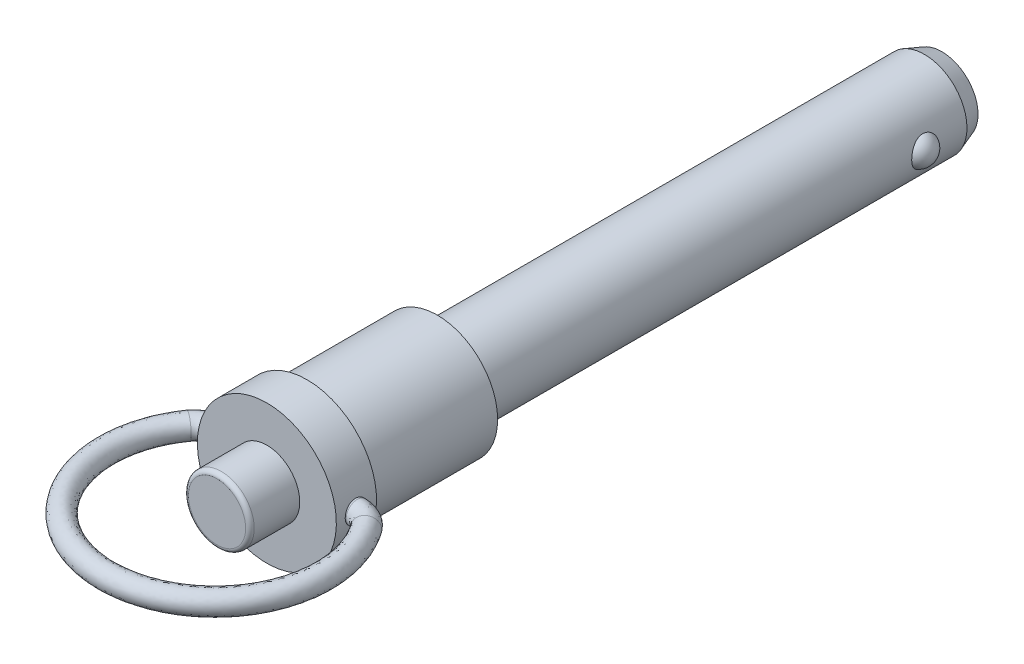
ISO-10303-21;
HEADER;
FILE_DESCRIPTION(('STEP AP214'),'2;1');
FILE_NAME('part.step','',(''),(''),'','','');
FILE_SCHEMA(('AUTOMOTIVE_DESIGN { 1 0 10303 214 1 1 1 1 }'));
ENDSEC;
DATA;
#1=APPLICATION_CONTEXT('core data for automotive mechanical design processes');
#2=APPLICATION_PROTOCOL_DEFINITION('international standard','automotive_design',2000,#1);
#3=PRODUCT_CONTEXT('',#1,'mechanical');
#4=PRODUCT('Part','Part','',(#3));
#5=PRODUCT_RELATED_PRODUCT_CATEGORY('part','',(#4));
#6=PRODUCT_DEFINITION_FORMATION('','',#4);
#7=PRODUCT_DEFINITION_CONTEXT('part definition',#1,'design');
#8=PRODUCT_DEFINITION('design','',#6,#7);
#9=PRODUCT_DEFINITION_SHAPE('','',#8);
#10=(LENGTH_UNIT() NAMED_UNIT(*) SI_UNIT(.MILLI.,.METRE.));
#11=(NAMED_UNIT(*) PLANE_ANGLE_UNIT() SI_UNIT($,.RADIAN.));
#12=(NAMED_UNIT(*) SI_UNIT($,.STERADIAN.) SOLID_ANGLE_UNIT());
#13=UNCERTAINTY_MEASURE_WITH_UNIT(LENGTH_MEASURE(1.E-05),#10,'distance_accuracy_value','');
#14=(GEOMETRIC_REPRESENTATION_CONTEXT(3) GLOBAL_UNCERTAINTY_ASSIGNED_CONTEXT((#13)) GLOBAL_UNIT_ASSIGNED_CONTEXT((#10,
#11,#12)) REPRESENTATION_CONTEXT('',''));
#15=CARTESIAN_POINT('',(0.,0.,0.));
#16=DIRECTION('',(0.,0.,1.));
#17=DIRECTION('',(1.,0.,0.));
#18=AXIS2_PLACEMENT_3D('',#15,#16,#17);
#19=CARTESIAN_POINT('',(4.22992248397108,0.,-59.0106));
#20=DIRECTION('',(0.,0.,1.));
#21=DIRECTION('',(0.,-1.,0.));
#22=AXIS2_PLACEMENT_3D('',#19,#20,#21);
#23=PLANE('',#22);
#24=CARTESIAN_POINT('',(0.,0.,-59.0105999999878));
#25=DIRECTION('',(0.,0.,1.));
#26=DIRECTION('',(0.,-1.,0.));
#27=AXIS2_PLACEMENT_3D('',#24,#25,#26);
#28=CIRCLE('',#27,4.22992248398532);
#29=CARTESIAN_POINT('',(0.,-4.22992248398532,-59.0105999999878));
#30=VERTEX_POINT('',#29);
#31=EDGE_CURVE('E146',#30,#30,#28,.T.);
#32=ORIENTED_EDGE('',*,*,#31,.F.);
#33=EDGE_LOOP('',(#32));
#34=FACE_BOUND('',#33,.T.);
#35=ADVANCED_FACE('F12',(#34),#23,.F.);
#36=CARTESIAN_POINT('',(4.14528,0.,-52.1018));
#37=DIRECTION('',(0.,0.,1.));
#38=DIRECTION('',(1.,0.,0.));
#39=AXIS2_PLACEMENT_3D('',#36,#37,#38);
#40=SPHERICAL_SURFACE('',#39,1.78562);
#41=CARTESIAN_POINT('',(4.96951,0.,-50.5177912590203));
#42=CARTESIAN_POINT('',(4.96950607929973,0.0989420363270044,-50.5177939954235));
#43=CARTESIAN_POINT('',(4.96652601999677,0.197972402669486,-50.5255413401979));
#44=CARTESIAN_POINT('',(4.9548871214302,0.393364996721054,-50.5564575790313));
#45=CARTESIAN_POINT('',(4.94621961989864,0.489722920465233,-50.5796499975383));
#46=CARTESIAN_POINT('',(4.92409154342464,0.676928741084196,-50.6411551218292));
#47=CARTESIAN_POINT('',(4.91063084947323,0.767776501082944,-50.6794682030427));
#48=CARTESIAN_POINT('',(4.88035492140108,0.941233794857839,-50.7706319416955));
#49=CARTESIAN_POINT('',(4.86354066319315,1.02384571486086,-50.8234783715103));
#50=CARTESIAN_POINT('',(4.82872838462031,1.17707237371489,-50.9418991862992));
#51=CARTESIAN_POINT('',(4.81075207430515,1.24784944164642,-51.0072693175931));
#52=CARTESIAN_POINT('',(4.77554803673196,1.37645403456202,-51.1499084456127));
#53=CARTESIAN_POINT('',(4.75832009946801,1.43428521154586,-51.2271740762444));
#54=CARTESIAN_POINT('',(4.72780678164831,1.53177669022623,-51.3868084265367));
#55=CARTESIAN_POINT('',(4.71434983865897,1.57230137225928,-51.4686150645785));
#56=CARTESIAN_POINT('',(4.69186742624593,1.63818072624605,-51.6386872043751));
#57=CARTESIAN_POINT('',(4.68283895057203,1.66354569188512,-51.7269482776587));
#58=CARTESIAN_POINT('',(4.6709836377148,1.69653228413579,-51.8994503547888));
#59=CARTESIAN_POINT('',(4.66770209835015,1.70545809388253,-51.9834120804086));
#60=CARTESIAN_POINT('',(4.66631401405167,1.70925445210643,-52.1516845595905));
#61=CARTESIAN_POINT('',(4.6682059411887,1.70412915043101,-52.2359952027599));
#62=CARTESIAN_POINT('',(4.67672634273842,1.68059540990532,-52.3985435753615));
#63=CARTESIAN_POINT('',(4.68313557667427,1.66280143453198,-52.4768831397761));
#64=CARTESIAN_POINT('',(4.69974058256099,1.61527018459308,-52.6294056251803));
#65=CARTESIAN_POINT('',(4.70993669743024,1.58553182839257,-52.7035881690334));
#66=CARTESIAN_POINT('',(4.73339939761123,1.51406854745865,-52.8481011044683));
#67=CARTESIAN_POINT('',(4.74674458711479,1.47202873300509,-52.9182634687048));
#68=CARTESIAN_POINT('',(4.7679135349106,1.40129782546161,-53.0176828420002));
#69=CARTESIAN_POINT('',(4.77516406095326,1.37643370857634,-53.049860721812));
#70=CARTESIAN_POINT('',(4.7898870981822,1.32429117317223,-53.112185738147));
#71=CARTESIAN_POINT('',(4.79735977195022,1.29701095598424,-53.1423313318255));
#72=CARTESIAN_POINT('',(4.82096563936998,1.20759667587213,-53.2338189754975));
#73=CARTESIAN_POINT('',(4.83719300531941,1.14140257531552,-53.2912462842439));
#74=CARTESIAN_POINT('',(4.86827537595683,1.00055962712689,-53.3950513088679));
#75=CARTESIAN_POINT('',(4.88312976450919,0.92590701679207,-53.441424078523));
#76=CARTESIAN_POINT('',(4.90385674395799,0.806241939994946,-53.5036735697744));
#77=CARTESIAN_POINT('',(4.91070233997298,0.763519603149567,-53.5237258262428));
#78=CARTESIAN_POINT('',(4.92344025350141,0.676535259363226,-53.5603862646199));
#79=CARTESIAN_POINT('',(4.92933338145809,0.632274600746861,-53.5769973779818));
#80=CARTESIAN_POINT('',(4.94535278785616,0.497629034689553,-53.6215733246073));
#81=CARTESIAN_POINT('',(4.95384366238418,0.405242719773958,-53.6443519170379));
#82=CARTESIAN_POINT('',(4.96296311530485,0.260199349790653,-53.6686021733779));
#83=CARTESIAN_POINT('',(4.96541051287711,0.208410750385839,-53.6750499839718));
#84=CARTESIAN_POINT('',(4.96868499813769,0.104422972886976,-53.6836540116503));
#85=CARTESIAN_POINT('',(4.96951206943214,0.0522237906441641,-53.6858101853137));
#86=CARTESIAN_POINT('',(4.96950607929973,-0.0989420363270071,-53.6858060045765));
#87=CARTESIAN_POINT('',(4.96652601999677,-0.197972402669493,-53.6780586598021));
#88=CARTESIAN_POINT('',(4.9548871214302,-0.393364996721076,-53.6471424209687));
#89=CARTESIAN_POINT('',(4.94621961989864,-0.489722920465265,-53.6239500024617));
#90=CARTESIAN_POINT('',(4.92409154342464,-0.676928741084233,-53.5624448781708));
#91=CARTESIAN_POINT('',(4.91063084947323,-0.767776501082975,-53.5241317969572));
#92=CARTESIAN_POINT('',(4.88035492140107,-0.941233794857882,-53.4329680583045));
#93=CARTESIAN_POINT('',(4.86354066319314,-1.02384571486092,-53.3801216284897));
#94=CARTESIAN_POINT('',(4.8287283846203,-1.17707237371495,-53.2617008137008));
#95=CARTESIAN_POINT('',(4.81075207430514,-1.24784944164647,-53.1963306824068));
#96=CARTESIAN_POINT('',(4.77554803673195,-1.37645403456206,-53.0536915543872));
#97=CARTESIAN_POINT('',(4.758320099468,-1.4342852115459,-52.9764259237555));
#98=CARTESIAN_POINT('',(4.7278067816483,-1.53177669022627,-52.8167915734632));
#99=CARTESIAN_POINT('',(4.71434983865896,-1.57230137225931,-52.7349849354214));
#100=CARTESIAN_POINT('',(4.69186742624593,-1.63818072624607,-52.5649127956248));
#101=CARTESIAN_POINT('',(4.68283895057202,-1.66354569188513,-52.4766517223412));
#102=CARTESIAN_POINT('',(4.6709836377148,-1.69653228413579,-52.3041496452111));
#103=CARTESIAN_POINT('',(4.66770209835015,-1.70545809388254,-52.2201879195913));
#104=CARTESIAN_POINT('',(4.66631401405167,-1.70925445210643,-52.0519154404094));
#105=CARTESIAN_POINT('',(4.6682059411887,-1.704129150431,-51.96760479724));
#106=CARTESIAN_POINT('',(4.67672634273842,-1.68059540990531,-51.8050564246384));
#107=CARTESIAN_POINT('',(4.68313557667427,-1.66280143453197,-51.7267168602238));
#108=CARTESIAN_POINT('',(4.699740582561,-1.61527018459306,-51.5741943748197));
#109=CARTESIAN_POINT('',(4.70993669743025,-1.58553182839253,-51.5000118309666));
#110=CARTESIAN_POINT('',(4.73339939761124,-1.51406854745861,-51.3554988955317));
#111=CARTESIAN_POINT('',(4.7467445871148,-1.47202873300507,-51.2853365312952));
#112=CARTESIAN_POINT('',(4.7679135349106,-1.40129782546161,-51.1859171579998));
#113=CARTESIAN_POINT('',(4.77516406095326,-1.37643370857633,-51.153739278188));
#114=CARTESIAN_POINT('',(4.7898870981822,-1.3242911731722,-51.091414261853));
#115=CARTESIAN_POINT('',(4.79735977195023,-1.29701095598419,-51.0612686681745));
#116=CARTESIAN_POINT('',(4.82096563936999,-1.20759667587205,-50.9697810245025));
#117=CARTESIAN_POINT('',(4.83719300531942,-1.14140257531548,-50.912353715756));
#118=CARTESIAN_POINT('',(4.86827537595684,-1.00055962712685,-50.8085486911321));
#119=CARTESIAN_POINT('',(4.8831297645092,-0.925907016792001,-50.762175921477));
#120=CARTESIAN_POINT('',(4.903856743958,-0.806241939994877,-50.6999264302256));
#121=CARTESIAN_POINT('',(4.91070233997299,-0.763519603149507,-50.6798741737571));
#122=CARTESIAN_POINT('',(4.92344025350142,-0.676535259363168,-50.6432137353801));
#123=CARTESIAN_POINT('',(4.9293333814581,-0.632274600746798,-50.6266026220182));
#124=CARTESIAN_POINT('',(4.94535278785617,-0.497629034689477,-50.5820266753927));
#125=CARTESIAN_POINT('',(4.95384366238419,-0.40524271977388,-50.5592480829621));
#126=CARTESIAN_POINT('',(4.96296311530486,-0.260199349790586,-50.5349978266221));
#127=CARTESIAN_POINT('',(4.96541051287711,-0.208410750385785,-50.5285500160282));
#128=CARTESIAN_POINT('',(4.96868499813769,-0.104422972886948,-50.5199459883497));
#129=CARTESIAN_POINT('',(4.96951206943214,-0.0522237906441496,-50.5177898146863));
#130=CARTESIAN_POINT('',(4.96951,0.,-50.5177912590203));
#131=B_SPLINE_CURVE_WITH_KNOTS('',3,(#41,#42,#43,#44,#45,#46,#47,#48,#49,#50,#51,#52,#53,#54,
#55,#56,#57,#58,#59,#60,#61,#62,#63,#64,#65,#66,#67,#68,#69,#70,#71,#72,#73,#74,#75,#76,#77,#78,
#79,#80,#81,#82,#83,#84,#85,#86,#87,#88,#89,#90,#91,#92,#93,#94,#95,#96,#97,#98,#99,#100,#101,
#102,#103,#104,#105,#106,#107,#108,#109,#110,#111,#112,#113,#114,#115,#116,#117,#118,#119,#120,
#121,#122,#123,#124,#125,#126,#127,#128,#129,#130),.UNSPECIFIED.,.T.,.F.,(4,2,2,2,2,2,2,2,2,2,2,
2,2,2,2,2,2,2,2,2,2,2,2,2,2,2,2,2,2,2,2,2,2,2,2,2,2,2,2,2,2,2,2,2,4),(0.,0.296633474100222,
0.593719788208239,0.890813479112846,1.18782083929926,1.48034313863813,1.77278281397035,
2.04813279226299,2.32329559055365,2.57549318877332,2.82761631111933,3.06827754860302,
3.30896058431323,3.55644296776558,3.68025851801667,3.8041670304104,4.07032015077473,
4.33659213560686,4.4795106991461,4.62230700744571,4.9074338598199,5.06400197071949,
5.22057166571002,5.51720513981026,5.81429145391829,6.11138514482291,6.40839250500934,
6.70091480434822,6.99335447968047,7.26870445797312,7.54386725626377,7.79606485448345,
8.04818797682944,8.28884921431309,8.52953225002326,8.77701463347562,8.90083018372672,
9.02473869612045,9.2908918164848,9.55716380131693,9.70008236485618,9.84287867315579,
10.12800552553,10.2845736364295,10.44114333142),.UNSPECIFIED.);
#132=CARTESIAN_POINT('',(4.96951,0.,-50.5177912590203));
#133=VERTEX_POINT('',#132);
#134=EDGE_CURVE('E30',#133,#133,#131,.T.);
#135=ORIENTED_EDGE('',*,*,#134,.F.);
#136=EDGE_LOOP('',(#135));
#137=FACE_BOUND('',#136,.T.);
#138=ADVANCED_FACE('F131',(#137),#40,.T.);
#139=CARTESIAN_POINT('',(-4.14274,0.,-52.1018));
#140=DIRECTION('',(0.,0.,1.));
#141=DIRECTION('',(1.,0.,0.));
#142=AXIS2_PLACEMENT_3D('',#139,#140,#141);
#143=SPHERICAL_SURFACE('',#142,1.78562);
#144=CARTESIAN_POINT('',(-4.96951,0.,-53.6844844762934));
#145=CARTESIAN_POINT('',(-4.96950608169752,0.0989139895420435,-53.6844817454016));
#146=CARTESIAN_POINT('',(-4.96652771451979,0.197916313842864,-53.6767370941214));
#147=CARTESIAN_POINT('',(-4.95489537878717,0.393254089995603,-53.6458311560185));
#148=CARTESIAN_POINT('',(-4.94623274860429,0.489585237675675,-53.6226463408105));
#149=CARTESIAN_POINT('',(-4.92411699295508,0.676739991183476,-53.5611597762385));
#150=CARTESIAN_POINT('',(-4.91066371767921,0.767563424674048,-53.5228575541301));
#151=CARTESIAN_POINT('',(-4.88040469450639,0.94097334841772,-53.4317169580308));
#152=CARTESIAN_POINT('',(-4.86359992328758,1.02356222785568,-53.3788828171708));
#153=CARTESIAN_POINT('',(-4.82881079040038,1.17673191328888,-53.2604940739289));
#154=CARTESIAN_POINT('',(-4.81084830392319,1.24747651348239,-53.1951455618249));
#155=CARTESIAN_POINT('',(-4.77567379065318,1.37601594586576,-53.0525512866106));
#156=CARTESIAN_POINT('',(-4.75846155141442,1.43381446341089,-52.975308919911));
#157=CARTESIAN_POINT('',(-4.72798568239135,1.53122269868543,-52.8157481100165));
#158=CARTESIAN_POINT('',(-4.71454945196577,1.57170168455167,-52.7339947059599));
#159=CARTESIAN_POINT('',(-4.69210654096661,1.63749472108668,-52.5640357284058));
#160=CARTESIAN_POINT('',(-4.68309684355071,1.66281910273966,-52.4758345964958));
#161=CARTESIAN_POINT('',(-4.67127565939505,1.69572762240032,-52.3034786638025));
#162=CARTESIAN_POINT('',(-4.66800833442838,1.70461968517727,-52.2196034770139));
#163=CARTESIAN_POINT('',(-4.66664096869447,1.70836155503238,-52.0515092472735));
#164=CARTESIAN_POINT('',(-4.66853940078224,1.70321551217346,-51.967290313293));
#165=CARTESIAN_POINT('',(-4.67706392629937,1.67965578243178,-51.8049283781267));
#166=CARTESIAN_POINT('',(-4.68347088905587,1.6618566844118,-51.7266833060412));
#167=CARTESIAN_POINT('',(-4.7000634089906,1.61433052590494,-51.5743485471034));
#168=CARTESIAN_POINT('',(-4.7102493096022,1.58460238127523,-51.5002592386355));
#169=CARTESIAN_POINT('',(-4.73368609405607,1.51317152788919,-51.3559218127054));
#170=CARTESIAN_POINT('',(-4.74701574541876,1.47115297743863,-51.2858423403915));
#171=CARTESIAN_POINT('',(-4.76815825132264,1.40046463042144,-51.1865421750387));
#172=CARTESIAN_POINT('',(-4.77539944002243,1.3756164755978,-51.1544031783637));
#173=CARTESIAN_POINT('',(-4.79010305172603,1.32350942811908,-51.0921539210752));
#174=CARTESIAN_POINT('',(-4.79756563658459,1.2962487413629,-51.0620452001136));
#175=CARTESIAN_POINT('',(-4.82114242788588,1.206888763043,-50.9706568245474));
#176=CARTESIAN_POINT('',(-4.83735008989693,1.14073361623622,-50.9132896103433));
#177=CARTESIAN_POINT('',(-4.86839378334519,0.999979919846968,-50.8095945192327));
#178=CARTESIAN_POINT('',(-4.88322919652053,0.925377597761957,-50.7632716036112));
#179=CARTESIAN_POINT('',(-4.90393144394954,0.805786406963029,-50.7010831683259));
#180=CARTESIAN_POINT('',(-4.91076989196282,0.763083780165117,-50.6810475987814));
#181=CARTESIAN_POINT('',(-4.92349428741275,0.676140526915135,-50.6444182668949));
#182=CARTESIAN_POINT('',(-4.92938104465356,0.631901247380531,-50.6278215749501));
#183=CARTESIAN_POINT('',(-4.94538285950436,0.497321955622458,-50.5832850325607));
#184=CARTESIAN_POINT('',(-4.95386398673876,0.404982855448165,-50.5605276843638));
#185=CARTESIAN_POINT('',(-4.96297201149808,0.260022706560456,-50.5363025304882));
#186=CARTESIAN_POINT('',(-4.96541608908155,0.208269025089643,-50.5298620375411));
#187=CARTESIAN_POINT('',(-4.96868612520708,0.104351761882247,-50.5212677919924));
#188=CARTESIAN_POINT('',(-4.96951206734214,0.0521881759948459,-50.5191140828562));
#189=CARTESIAN_POINT('',(-4.96950608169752,-0.0989139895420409,-50.5191182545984));
#190=CARTESIAN_POINT('',(-4.96652771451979,-0.197916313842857,-50.5268629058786));
#191=CARTESIAN_POINT('',(-4.95489537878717,-0.393254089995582,-50.5577688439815));
#192=CARTESIAN_POINT('',(-4.9462327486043,-0.489585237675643,-50.5809536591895));
#193=CARTESIAN_POINT('',(-4.92411699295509,-0.67673999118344,-50.6424402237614));
#194=CARTESIAN_POINT('',(-4.91066371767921,-0.767563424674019,-50.6807424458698));
#195=CARTESIAN_POINT('',(-4.8804046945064,-0.940973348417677,-50.7718830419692));
#196=CARTESIAN_POINT('',(-4.86359992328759,-1.02356222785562,-50.8247171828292));
#197=CARTESIAN_POINT('',(-4.82881079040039,-1.17673191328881,-50.9431059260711));
#198=CARTESIAN_POINT('',(-4.8108483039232,-1.24747651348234,-51.0084544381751));
#199=CARTESIAN_POINT('',(-4.7756737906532,-1.37601594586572,-51.1510487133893));
#200=CARTESIAN_POINT('',(-4.75846155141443,-1.43381446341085,-51.2282910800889));
#201=CARTESIAN_POINT('',(-4.72798568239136,-1.53122269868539,-51.3878518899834));
#202=CARTESIAN_POINT('',(-4.71454945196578,-1.57170168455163,-51.46960529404));
#203=CARTESIAN_POINT('',(-4.69210654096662,-1.63749472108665,-51.6395642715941));
#204=CARTESIAN_POINT('',(-4.68309684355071,-1.66281910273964,-51.7277654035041));
#205=CARTESIAN_POINT('',(-4.67127565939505,-1.69572762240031,-51.9001213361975));
#206=CARTESIAN_POINT('',(-4.66800833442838,-1.70461968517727,-51.983996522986));
#207=CARTESIAN_POINT('',(-4.66664096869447,-1.70836155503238,-52.1520907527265));
#208=CARTESIAN_POINT('',(-4.66853940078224,-1.70321551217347,-52.236309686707));
#209=CARTESIAN_POINT('',(-4.67706392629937,-1.6796557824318,-52.3986716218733));
#210=CARTESIAN_POINT('',(-4.68347088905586,-1.66185668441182,-52.4769166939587));
#211=CARTESIAN_POINT('',(-4.70006340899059,-1.61433052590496,-52.6292514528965));
#212=CARTESIAN_POINT('',(-4.71024930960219,-1.58460238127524,-52.7033407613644));
#213=CARTESIAN_POINT('',(-4.73368609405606,-1.51317152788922,-52.8476781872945));
#214=CARTESIAN_POINT('',(-4.74701574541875,-1.47115297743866,-52.9177576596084));
#215=CARTESIAN_POINT('',(-4.76815825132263,-1.40046463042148,-53.0170578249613));
#216=CARTESIAN_POINT('',(-4.77539944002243,-1.37561647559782,-53.0491968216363));
#217=CARTESIAN_POINT('',(-4.79010305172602,-1.32350942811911,-53.1114460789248));
#218=CARTESIAN_POINT('',(-4.79756563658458,-1.29624874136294,-53.1415547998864));
#219=CARTESIAN_POINT('',(-4.82114242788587,-1.20688876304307,-53.2329431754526));
#220=CARTESIAN_POINT('',(-4.83735008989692,-1.14073361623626,-53.2903103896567));
#221=CARTESIAN_POINT('',(-4.86839378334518,-0.999979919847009,-53.3940054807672));
#222=CARTESIAN_POINT('',(-4.88322919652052,-0.925377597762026,-53.4403283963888));
#223=CARTESIAN_POINT('',(-4.90393144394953,-0.805786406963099,-53.5025168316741));
#224=CARTESIAN_POINT('',(-4.91076989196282,-0.763083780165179,-53.5225524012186));
#225=CARTESIAN_POINT('',(-4.92349428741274,-0.676140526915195,-53.5591817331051));
#226=CARTESIAN_POINT('',(-4.92938104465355,-0.631901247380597,-53.5757784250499));
#227=CARTESIAN_POINT('',(-4.94538285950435,-0.497321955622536,-53.6203149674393));
#228=CARTESIAN_POINT('',(-4.95386398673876,-0.404982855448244,-53.6430723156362));
#229=CARTESIAN_POINT('',(-4.96297201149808,-0.260022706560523,-53.6672974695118));
#230=CARTESIAN_POINT('',(-4.96541608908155,-0.208269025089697,-53.6737379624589));
#231=CARTESIAN_POINT('',(-4.96868612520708,-0.104351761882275,-53.6823322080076));
#232=CARTESIAN_POINT('',(-4.96951206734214,-0.0521881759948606,-53.6844859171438));
#233=CARTESIAN_POINT('',(-4.96951,0.,-53.6844844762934));
#234=B_SPLINE_CURVE_WITH_KNOTS('',3,(#144,#145,#146,#147,#148,#149,#150,#151,#152,#153,#154,
#155,#156,#157,#158,#159,#160,#161,#162,#163,#164,#165,#166,#167,#168,#169,#170,#171,#172,#173,
#174,#175,#176,#177,#178,#179,#180,#181,#182,#183,#184,#185,#186,#187,#188,#189,#190,#191,#192,
#193,#194,#195,#196,#197,#198,#199,#200,#201,#202,#203,#204,#205,#206,#207,#208,#209,#210,#211,
#212,#213,#214,#215,#216,#217,#218,#219,#220,#221,#222,#223,#224,#225,#226,#227,#228,#229,#230,
#231,#232,#233),.UNSPECIFIED.,.T.,.F.,(4,2,2,2,2,2,2,2,2,2,2,2,2,2,2,2,2,2,2,2,2,2,2,2,2,2,2,2,
2,2,2,2,2,2,2,2,2,2,2,2,2,2,2,2,4),(0.,0.296549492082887,0.593551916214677,0.890563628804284,
1.18748891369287,1.47988990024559,1.77220754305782,2.04734712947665,2.32229893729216,
2.57422747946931,2.82608155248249,3.06647154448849,3.30688338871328,3.55411689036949,
3.67780799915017,3.80159187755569,4.06753268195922,4.3335927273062,4.47643431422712,
4.61915370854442,4.90412739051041,5.06058877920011,5.2170517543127,5.51360124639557,
5.81060367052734,6.10761538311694,6.40454066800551,6.69694165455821,6.98925929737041,
7.26439888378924,7.53935069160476,7.79127923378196,8.04313330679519,8.28352329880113,
8.52393514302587,8.77116864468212,8.89485975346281,9.01864363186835,9.28458443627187,
9.55064448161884,9.69348606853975,9.83620546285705,10.121179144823,10.2776405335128,
10.4341035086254),.UNSPECIFIED.);
#235=CARTESIAN_POINT('',(-4.96951,0.,-53.6844844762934));
#236=VERTEX_POINT('',#235);
#237=EDGE_CURVE('E8',#236,#236,#234,.T.);
#238=ORIENTED_EDGE('',*,*,#237,.F.);
#239=EDGE_LOOP('',(#238));
#240=FACE_BOUND('',#239,.T.);
#241=ADVANCED_FACE('F44',(#240),#143,.T.);
#242=CARTESIAN_POINT('',(0.,0.,-56.978600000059));
#243=DIRECTION('',(0.,0.,1.));
#244=DIRECTION('',(0.,-1.,0.));
#245=AXIS2_PLACEMENT_3D('',#242,#243,#244);
#246=CONICAL_SURFACE('',#245,4.96950999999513,0.349065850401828);
#247=ORIENTED_EDGE('',*,*,#31,.T.);
#248=EDGE_LOOP('',(#247));
#249=FACE_BOUND('',#248,.T.);
#250=CARTESIAN_POINT('',(0.,0.,-56.9786));
#251=DIRECTION('',(0.,0.,1.));
#252=DIRECTION('',(0.,-1.,0.));
#253=AXIS2_PLACEMENT_3D('',#250,#251,#252);
#254=CIRCLE('',#253,4.96951);
#255=CARTESIAN_POINT('',(0.,-4.96951,-56.9786));
#256=VERTEX_POINT('',#255);
#257=EDGE_CURVE('E25',#256,#256,#254,.T.);
#258=ORIENTED_EDGE('',*,*,#257,.F.);
#259=EDGE_LOOP('',(#258));
#260=FACE_BOUND('',#259,.T.);
#261=ADVANCED_FACE('F54',(#249,#260),#246,.T.);
#262=CARTESIAN_POINT('',(0.,0.,-25.));
#263=DIRECTION('',(0.,0.,1.));
#264=DIRECTION('',(-0.810321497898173,-0.585985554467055,0.));
#265=AXIS2_PLACEMENT_3D('',#262,#263,#264);
#266=CYLINDRICAL_SURFACE('',#265,4.96951);
#267=CARTESIAN_POINT('',(0.,0.,0.));
#268=DIRECTION('',(0.,0.,-1.));
#269=DIRECTION('',(0.,1.,0.));
#270=AXIS2_PLACEMENT_3D('',#267,#268,#269);
#271=CIRCLE('',#270,4.96951);
#272=CARTESIAN_POINT('',(0.,4.96951,0.));
#273=VERTEX_POINT('',#272);
#274=EDGE_CURVE('E143',#273,#273,#271,.T.);
#275=ORIENTED_EDGE('',*,*,#274,.T.);
#276=EDGE_LOOP('',(#275));
#277=FACE_BOUND('',#276,.T.);
#278=ORIENTED_EDGE('',*,*,#257,.T.);
#279=EDGE_LOOP('',(#278));
#280=FACE_BOUND('',#279,.T.);
#281=ORIENTED_EDGE('',*,*,#237,.T.);
#282=EDGE_LOOP('',(#281));
#283=FACE_BOUND('',#282,.T.);
#284=ORIENTED_EDGE('',*,*,#134,.T.);
#285=EDGE_LOOP('',(#284));
#286=FACE_BOUND('',#285,.T.);
#287=ADVANCED_FACE('F49',(#277,#280,#283,#286),#266,.T.);
#288=CARTESIAN_POINT('',(0.,0.,25.765));
#289=DIRECTION('',(0.,0.,1.));
#290=DIRECTION('',(1.,0.,0.));
#291=AXIS2_PLACEMENT_3D('',#288,#289,#290);
#292=PLANE('',#291);
#293=CARTESIAN_POINT('',(0.,0.,25.765));
#294=DIRECTION('',(0.,0.,1.));
#295=DIRECTION('',(1.,0.,0.));
#296=AXIS2_PLACEMENT_3D('',#293,#294,#295);
#297=CIRCLE('',#296,3.3481);
#298=CARTESIAN_POINT('',(3.3481,0.,25.765));
#299=VERTEX_POINT('',#298);
#300=EDGE_CURVE('E162',#299,#299,#297,.T.);
#301=ORIENTED_EDGE('',*,*,#300,.T.);
#302=EDGE_LOOP('',(#301));
#303=FACE_BOUND('',#302,.T.);
#304=ADVANCED_FACE('F53',(#303),#292,.T.);
#305=CARTESIAN_POINT('',(0.,0.,25.265));
#306=DIRECTION('',(0.,0.,1.));
#307=DIRECTION('',(1.,0.,0.));
#308=AXIS2_PLACEMENT_3D('',#305,#306,#307);
#309=TOROIDAL_SURFACE('',#308,3.3481,0.5);
#310=CARTESIAN_POINT('',(0.,0.,25.265));
#311=DIRECTION('',(0.,0.,1.));
#312=DIRECTION('',(1.,0.,0.));
#313=AXIS2_PLACEMENT_3D('',#310,#311,#312);
#314=CIRCLE('',#313,3.8481);
#315=CARTESIAN_POINT('',(3.8481,0.,25.265));
#316=VERTEX_POINT('',#315);
#317=EDGE_CURVE('E167',#316,#316,#314,.T.);
#318=ORIENTED_EDGE('',*,*,#317,.T.);
#319=EDGE_LOOP('',(#318));
#320=FACE_BOUND('',#319,.T.);
#321=ORIENTED_EDGE('',*,*,#300,.F.);
#322=EDGE_LOOP('',(#321));
#323=FACE_BOUND('',#322,.T.);
#324=ADVANCED_FACE('F76',(#320,#323),#309,.T.);
#325=CARTESIAN_POINT('',(11.4497733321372,0.,17.9437724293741));
#326=CARTESIAN_POINT('',(11.8265676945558,0.,18.4801460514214));
#327=CARTESIAN_POINT('',(12.6551080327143,0.,19.8662433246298));
#328=CARTESIAN_POINT('',(13.4882796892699,0.,22.0133244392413));
#329=CARTESIAN_POINT('',(14.0014195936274,0.,24.4938075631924));
#330=CARTESIAN_POINT('',(14.0399868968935,0.,27.1482100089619));
#331=CARTESIAN_POINT('',(13.5501253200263,0.,29.8733661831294));
#332=CARTESIAN_POINT('',(12.5103672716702,0.,32.4943169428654));
#333=CARTESIAN_POINT('',(10.9649059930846,0.,34.8529407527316));
#334=CARTESIAN_POINT('',(9.01915526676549,0.,36.8217510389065));
#335=CARTESIAN_POINT('',(6.82219687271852,0.,38.3176313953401));
#336=CARTESIAN_POINT('',(4.51156788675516,0.,39.3254677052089));
#337=CARTESIAN_POINT('',(2.23137128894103,0.,39.879227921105));
#338=CARTESIAN_POINT('',(7.28333001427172E-13,0.,40.0580345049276));
#339=CARTESIAN_POINT('',(-2.23137128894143,0.,39.879227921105));
#340=CARTESIAN_POINT('',(-4.51156788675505,0.,39.3254677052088));
#341=CARTESIAN_POINT('',(-6.82219687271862,0.,38.31763139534));
#342=CARTESIAN_POINT('',(-9.01915526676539,0.,36.8217510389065));
#343=CARTESIAN_POINT('',(-10.9649059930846,0.,34.8529407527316));
#344=CARTESIAN_POINT('',(-12.5103672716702,0.,32.4943169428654));
#345=CARTESIAN_POINT('',(-13.5501253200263,0.,29.8733661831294));
#346=CARTESIAN_POINT('',(-14.0399868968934,0.,27.148210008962));
#347=CARTESIAN_POINT('',(-14.0014195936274,0.,24.4938075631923));
#348=CARTESIAN_POINT('',(-13.4882796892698,0.,22.0133244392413));
#349=CARTESIAN_POINT('',(-12.6551080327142,0.,19.8662433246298));
#350=CARTESIAN_POINT('',(-11.8265676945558,0.,18.4801460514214));
#351=CARTESIAN_POINT('',(-11.4497733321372,0.,17.9437724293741));
#352=CARTESIAN_POINT('',(11.4497733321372,-2.59999999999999,17.9437724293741));
#353=CARTESIAN_POINT('',(11.7096770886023,-2.59999999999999,18.3137501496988));
#354=CARTESIAN_POINT('',(12.7137877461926,-2.59999999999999,19.9497749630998));
#355=CARTESIAN_POINT('',(13.4708176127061,-2.59999999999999,21.9884668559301));
#356=CARTESIAN_POINT('',(14.0065482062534,-2.6,24.5011082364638));
#357=CARTESIAN_POINT('',(14.0385176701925,-2.59999999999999,27.1461185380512));
#358=CARTESIAN_POINT('',(13.5505344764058,-2.59999999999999,29.8739486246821));
#359=CARTESIAN_POINT('',(12.5102566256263,-2.59999999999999,32.4941594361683));
#360=CARTESIAN_POINT('',(10.9649350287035,-2.59999999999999,34.8529820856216));
#361=CARTESIAN_POINT('',(9.01914786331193,-2.6,36.8217404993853));
#362=CARTESIAN_POINT('',(6.82219870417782,-2.59999999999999,38.3176340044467));
#363=CARTESIAN_POINT('',(4.51156744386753,-2.59999999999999,39.3254670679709));
#364=CARTESIAN_POINT('',(2.23137138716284,-2.59999999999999,39.879228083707));
#365=CARTESIAN_POINT('',(7.28268272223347E-13,-2.59999999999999,40.0580344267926));
#366=CARTESIAN_POINT('',(-2.23137138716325,-2.6,39.879228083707));
#367=CARTESIAN_POINT('',(-4.51156744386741,-2.59999999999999,39.3254670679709));
#368=CARTESIAN_POINT('',(-6.82219870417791,-2.6,38.3176340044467));
#369=CARTESIAN_POINT('',(-9.01914786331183,-2.59999999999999,36.8217404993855));
#370=CARTESIAN_POINT('',(-10.9649350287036,-2.59999999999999,34.8529820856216));
#371=CARTESIAN_POINT('',(-12.5102566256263,-2.59999999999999,32.4941594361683));
#372=CARTESIAN_POINT('',(-13.5505344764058,-2.59999999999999,29.8739486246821));
#373=CARTESIAN_POINT('',(-14.0385176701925,-2.6,27.1461185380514));
#374=CARTESIAN_POINT('',(-14.0065482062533,-2.59999999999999,24.5011082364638));
#375=CARTESIAN_POINT('',(-13.4708176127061,-2.59999999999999,21.9884668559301));
#376=CARTESIAN_POINT('',(-12.7137877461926,-2.59999999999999,19.9497749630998));
#377=CARTESIAN_POINT('',(-11.7096770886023,-2.59999999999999,18.3137501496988));
#378=CARTESIAN_POINT('',(-11.4497733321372,-2.59999999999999,17.9437724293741));
#379=CARTESIAN_POINT('',(9.33442519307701,-2.59999999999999,19.4556422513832));
#380=CARTESIAN_POINT('',(9.59432894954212,-2.59999999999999,19.8256199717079));
#381=CARTESIAN_POINT('',(10.3328710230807,-2.59999999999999,21.0505437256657));
#382=CARTESIAN_POINT('',(10.9823054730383,-2.59999999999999,22.7644201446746));
#383=CARTESIAN_POINT('',(11.4042672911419,-2.6,24.7888114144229));
#384=CARTESIAN_POINT('',(11.4306312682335,-2.59999999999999,26.9493701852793));
#385=CARTESIAN_POINT('',(11.0308912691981,-2.59999999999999,29.1626260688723));
#386=CARTESIAN_POINT('',(10.1828123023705,-2.59999999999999,31.2968985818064));
#387=CARTESIAN_POINT('',(8.92160036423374,-2.59999999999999,33.2166725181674));
#388=CARTESIAN_POINT('',(7.34098330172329,-2.6,34.8144779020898));
#389=CARTESIAN_POINT('',(5.5491258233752,-2.59999999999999,36.0332448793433));
#390=CARTESIAN_POINT('',(3.67550207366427,-2.59999999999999,36.8497543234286));
#391=CARTESIAN_POINT('',(1.8109997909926,-2.59999999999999,37.3021941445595));
#392=CARTESIAN_POINT('',(-9.61358135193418E-13,-2.59999999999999,37.4469985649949));
#393=CARTESIAN_POINT('',(-1.81099979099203,-2.6,37.3021941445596));
#394=CARTESIAN_POINT('',(-3.6755020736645,-2.59999999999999,36.8497543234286));
#395=CARTESIAN_POINT('',(-5.54912582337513,-2.6,36.0332448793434));
#396=CARTESIAN_POINT('',(-7.34098330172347,-2.59999999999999,34.8144779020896));
#397=CARTESIAN_POINT('',(-8.92160036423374,-2.59999999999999,33.2166725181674));
#398=CARTESIAN_POINT('',(-10.1828123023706,-2.59999999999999,31.2968985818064));
#399=CARTESIAN_POINT('',(-11.0308912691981,-2.59999999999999,29.1626260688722));
#400=CARTESIAN_POINT('',(-11.4306312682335,-2.6,26.9493701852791));
#401=CARTESIAN_POINT('',(-11.4042672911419,-2.59999999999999,24.7888114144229));
#402=CARTESIAN_POINT('',(-10.9823054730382,-2.59999999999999,22.7644201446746));
#403=CARTESIAN_POINT('',(-10.3328710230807,-2.59999999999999,21.0505437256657));
#404=CARTESIAN_POINT('',(-9.59432894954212,-2.59999999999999,19.8256199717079));
#405=CARTESIAN_POINT('',(-9.33442519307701,-2.59999999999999,19.4556422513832));
#406=CARTESIAN_POINT('',(9.33442519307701,0.,19.4556422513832));
#407=CARTESIAN_POINT('',(9.65277425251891,0.,19.9088179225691));
#408=CARTESIAN_POINT('',(10.3035311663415,0.,21.0087779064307));
#409=CARTESIAN_POINT('',(10.9910365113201,0.,22.7768489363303));
#410=CARTESIAN_POINT('',(11.4017029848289,0.,24.7851610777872));
#411=CARTESIAN_POINT('',(11.431365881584,0.,26.9504159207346));
#412=CARTESIAN_POINT('',(11.0306866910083,0.,29.1623348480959));
#413=CARTESIAN_POINT('',(10.1828676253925,0.,31.2969773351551));
#414=CARTESIAN_POINT('',(8.92158584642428,0.,33.2166518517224));
#415=CARTESIAN_POINT('',(7.34098700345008,0.,34.8144831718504));
#416=CARTESIAN_POINT('',(5.54912490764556,0.,36.03324357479));
#417=CARTESIAN_POINT('',(3.67550229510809,0.,36.8497546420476));
#418=CARTESIAN_POINT('',(1.8109997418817,0.,37.3021940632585));
#419=CARTESIAN_POINT('',(-9.6127182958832E-13,0.,37.4469986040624));
#420=CARTESIAN_POINT('',(-1.81099974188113,0.,37.3021940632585));
#421=CARTESIAN_POINT('',(-3.67550229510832,0.,36.8497546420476));
#422=CARTESIAN_POINT('',(-5.54912490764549,0.,36.03324357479));
#423=CARTESIAN_POINT('',(-7.34098700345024,0.,34.8144831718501));
#424=CARTESIAN_POINT('',(-8.92158584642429,0.,33.2166518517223));
#425=CARTESIAN_POINT('',(-10.1828676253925,0.,31.296977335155));
#426=CARTESIAN_POINT('',(-11.0306866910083,0.,29.1623348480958));
#427=CARTESIAN_POINT('',(-11.431365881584,0.,26.9504159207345));
#428=CARTESIAN_POINT('',(-11.4017029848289,0.,24.7851610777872));
#429=CARTESIAN_POINT('',(-10.9910365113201,0.,22.7768489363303));
#430=CARTESIAN_POINT('',(-10.3035311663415,0.,21.0087779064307));
#431=CARTESIAN_POINT('',(-9.6527742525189,0.,19.9088179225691));
#432=CARTESIAN_POINT('',(-9.33442519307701,0.,19.4556422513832));
#433=CARTESIAN_POINT('',(9.33442519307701,2.59999999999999,19.4556422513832));
#434=CARTESIAN_POINT('',(9.7112195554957,2.59999999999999,19.9920158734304));
#435=CARTESIAN_POINT('',(10.2741913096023,2.59999999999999,20.9670120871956));
#436=CARTESIAN_POINT('',(10.999767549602,2.59999999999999,22.7892777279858));
#437=CARTESIAN_POINT('',(11.3991386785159,2.6,24.7815107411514));
#438=CARTESIAN_POINT('',(11.4321004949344,2.59999999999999,26.9514616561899));
#439=CARTESIAN_POINT('',(11.0304821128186,2.59999999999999,29.1620436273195));
#440=CARTESIAN_POINT('',(10.1829229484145,2.59999999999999,31.2970560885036));
#441=CARTESIAN_POINT('',(8.92157132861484,2.59999999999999,33.2166311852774));
#442=CARTESIAN_POINT('',(7.34099070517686,2.6,34.8144884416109));
#443=CARTESIAN_POINT('',(5.54912399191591,2.59999999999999,36.0332422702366));
#444=CARTESIAN_POINT('',(3.67550251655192,2.59999999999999,36.8497549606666));
#445=CARTESIAN_POINT('',(1.81099969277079,2.59999999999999,37.3021939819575));
#446=CARTESIAN_POINT('',(-9.61422864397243E-13,2.59999999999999,37.4469986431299));
#447=CARTESIAN_POINT('',(-1.81099969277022,2.6,37.3021939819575));
#448=CARTESIAN_POINT('',(-3.67550251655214,2.59999999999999,36.8497549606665));
#449=CARTESIAN_POINT('',(-5.54912399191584,2.6,36.0332422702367));
#450=CARTESIAN_POINT('',(-7.34099070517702,2.59999999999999,34.8144884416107));
#451=CARTESIAN_POINT('',(-8.92157132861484,2.59999999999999,33.2166311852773));
#452=CARTESIAN_POINT('',(-10.1829229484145,2.59999999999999,31.2970560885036));
#453=CARTESIAN_POINT('',(-11.0304821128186,2.59999999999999,29.1620436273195));
#454=CARTESIAN_POINT('',(-11.4321004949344,2.6,26.9514616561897));
#455=CARTESIAN_POINT('',(-11.3991386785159,2.59999999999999,24.7815107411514));
#456=CARTESIAN_POINT('',(-10.999767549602,2.59999999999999,22.7892777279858));
#457=CARTESIAN_POINT('',(-10.2741913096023,2.59999999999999,20.9670120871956));
#458=CARTESIAN_POINT('',(-9.71121955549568,2.59999999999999,19.9920158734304));
#459=CARTESIAN_POINT('',(-9.33442519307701,2.59999999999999,19.4556422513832));
#460=CARTESIAN_POINT('',(11.4497733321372,2.59999999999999,17.9437724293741));
#461=CARTESIAN_POINT('',(11.9434583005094,2.59999999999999,18.6465419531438));
#462=CARTESIAN_POINT('',(12.5964283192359,2.59999999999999,19.7827116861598));
#463=CARTESIAN_POINT('',(13.5057417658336,2.59999999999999,22.0381820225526));
#464=CARTESIAN_POINT('',(13.9962909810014,2.6,24.4865068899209));
#465=CARTESIAN_POINT('',(14.0414561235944,2.59999999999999,27.1503014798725));
#466=CARTESIAN_POINT('',(13.5497161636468,2.59999999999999,29.8727837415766));
#467=CARTESIAN_POINT('',(12.5104779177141,2.59999999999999,32.4944744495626));
#468=CARTESIAN_POINT('',(10.9648769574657,2.59999999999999,34.8528994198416));
#469=CARTESIAN_POINT('',(9.01916267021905,2.6,36.8217615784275));
#470=CARTESIAN_POINT('',(6.82219504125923,2.59999999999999,38.3176287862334));
#471=CARTESIAN_POINT('',(4.5115683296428,2.59999999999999,39.3254683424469));
#472=CARTESIAN_POINT('',(2.23137119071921,2.59999999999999,39.8792277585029));
#473=CARTESIAN_POINT('',(7.28203543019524E-13,2.59999999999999,40.0580345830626));
#474=CARTESIAN_POINT('',(-2.23137119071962,2.6,39.879227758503));
#475=CARTESIAN_POINT('',(-4.51156832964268,2.59999999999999,39.3254683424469));
#476=CARTESIAN_POINT('',(-6.82219504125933,2.6,38.3176287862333));
#477=CARTESIAN_POINT('',(-9.01916267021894,2.59999999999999,36.8217615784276));
#478=CARTESIAN_POINT('',(-10.9648769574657,2.59999999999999,34.8528994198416));
#479=CARTESIAN_POINT('',(-12.5104779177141,2.59999999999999,32.4944744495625));
#480=CARTESIAN_POINT('',(-13.5497161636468,2.59999999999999,29.8727837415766));
#481=CARTESIAN_POINT('',(-14.0414561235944,2.6,27.1503014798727));
#482=CARTESIAN_POINT('',(-13.9962909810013,2.59999999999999,24.4865068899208));
#483=CARTESIAN_POINT('',(-13.5057417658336,2.59999999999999,22.0381820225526));
#484=CARTESIAN_POINT('',(-12.5964283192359,2.59999999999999,19.7827116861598));
#485=CARTESIAN_POINT('',(-11.9434583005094,2.59999999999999,18.6465419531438));
#486=CARTESIAN_POINT('',(-11.4497733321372,2.59999999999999,17.9437724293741));
#487=CARTESIAN_POINT('',(11.4497733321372,0.,17.9437724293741));
#488=CARTESIAN_POINT('',(11.8265676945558,0.,18.4801460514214));
#489=CARTESIAN_POINT('',(12.6551080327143,0.,19.8662433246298));
#490=CARTESIAN_POINT('',(13.4882796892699,0.,22.0133244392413));
#491=CARTESIAN_POINT('',(14.0014195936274,0.,24.4938075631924));
#492=CARTESIAN_POINT('',(14.0399868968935,0.,27.1482100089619));
#493=CARTESIAN_POINT('',(13.5501253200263,0.,29.8733661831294));
#494=CARTESIAN_POINT('',(12.5103672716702,0.,32.4943169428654));
#495=CARTESIAN_POINT('',(10.9649059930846,0.,34.8529407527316));
#496=CARTESIAN_POINT('',(9.01915526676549,0.,36.8217510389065));
#497=CARTESIAN_POINT('',(6.82219687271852,0.,38.3176313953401));
#498=CARTESIAN_POINT('',(4.51156788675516,0.,39.3254677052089));
#499=CARTESIAN_POINT('',(2.23137128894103,0.,39.879227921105));
#500=CARTESIAN_POINT('',(7.28333001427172E-13,0.,40.0580345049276));
#501=CARTESIAN_POINT('',(-2.23137128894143,0.,39.879227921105));
#502=CARTESIAN_POINT('',(-4.51156788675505,0.,39.3254677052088));
#503=CARTESIAN_POINT('',(-6.82219687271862,0.,38.31763139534));
#504=CARTESIAN_POINT('',(-9.01915526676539,0.,36.8217510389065));
#505=CARTESIAN_POINT('',(-10.9649059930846,0.,34.8529407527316));
#506=CARTESIAN_POINT('',(-12.5103672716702,0.,32.4943169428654));
#507=CARTESIAN_POINT('',(-13.5501253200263,0.,29.8733661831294));
#508=CARTESIAN_POINT('',(-14.0399868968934,0.,27.148210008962));
#509=CARTESIAN_POINT('',(-14.0014195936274,0.,24.4938075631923));
#510=CARTESIAN_POINT('',(-13.4882796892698,0.,22.0133244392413));
#511=CARTESIAN_POINT('',(-12.6551080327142,0.,19.8662433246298));
#512=CARTESIAN_POINT('',(-11.8265676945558,0.,18.4801460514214));
#513=CARTESIAN_POINT('',(-11.4497733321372,0.,17.9437724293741));
#514=(BOUNDED_SURFACE() B_SPLINE_SURFACE(3,3,((#325,#326,#327,#328,#329,#330,#331,#332,#333,
#334,#335,#336,#337,#338,#339,#340,#341,#342,#343,#344,#345,#346,#347,#348,#349,#350,#351),
(#352,#353,#354,#355,#356,#357,#358,#359,#360,#361,#362,#363,#364,#365,#366,#367,#368,#369,#370,
#371,#372,#373,#374,#375,#376,#377,#378),(#379,#380,#381,#382,#383,#384,#385,#386,#387,#388,
#389,#390,#391,#392,#393,#394,#395,#396,#397,#398,#399,#400,#401,#402,#403,#404,#405),(#406,
#407,#408,#409,#410,#411,#412,#413,#414,#415,#416,#417,#418,#419,#420,#421,#422,#423,#424,#425,
#426,#427,#428,#429,#430,#431,#432),(#433,#434,#435,#436,#437,#438,#439,#440,#441,#442,#443,
#444,#445,#446,#447,#448,#449,#450,#451,#452,#453,#454,#455,#456,#457,#458,#459),(#460,#461,
#462,#463,#464,#465,#466,#467,#468,#469,#470,#471,#472,#473,#474,#475,#476,#477,#478,#479,#480,
#481,#482,#483,#484,#485,#486),(#487,#488,#489,#490,#491,#492,#493,#494,#495,#496,#497,#498,
#499,#500,#501,#502,#503,#504,#505,#506,#507,#508,#509,#510,#511,#512,#513)),.UNSPECIFIED.,.T.,
.F.,.F.) B_SPLINE_SURFACE_WITH_KNOTS((4,3,4),(4,1,1,1,1,1,1,1,1,1,1,1,1,1,1,1,1,1,1,1,1,1,1,1,
4),(0.,0.5,1.),(0.,0.0355177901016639,0.0739139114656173,0.114982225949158,0.158533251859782,
0.203808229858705,0.250000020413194,0.296191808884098,0.34146678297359,0.385017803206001,
0.426086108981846,0.464482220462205,0.5,0.535517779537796,0.573913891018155,0.614982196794,
0.658533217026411,0.703808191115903,0.749999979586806,0.796191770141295,0.841466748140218,
0.885017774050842,0.926086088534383,0.964482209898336,1.),
.UNSPECIFIED.) GEOMETRIC_REPRESENTATION_ITEM() RATIONAL_B_SPLINE_SURFACE(((1.,1.,1.,1.,1.,1.,1.,
1.,1.,1.,1.,1.,1.,1.,1.,1.,1.,1.,1.,1.,1.,1.,1.,1.,1.,1.,1.),(0.333333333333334,
0.333333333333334,0.333333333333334,0.333333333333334,0.333333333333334,0.333333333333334,
0.333333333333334,0.333333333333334,0.333333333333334,0.333333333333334,0.333333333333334,
0.333333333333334,0.333333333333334,0.333333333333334,0.333333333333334,0.333333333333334,
0.333333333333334,0.333333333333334,0.333333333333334,0.333333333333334,0.333333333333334,
0.333333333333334,0.333333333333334,0.333333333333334,0.333333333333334,0.333333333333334,
0.333333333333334),(0.333333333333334,0.333333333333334,0.333333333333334,0.333333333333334,
0.333333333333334,0.333333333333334,0.333333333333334,0.333333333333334,0.333333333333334,
0.333333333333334,0.333333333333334,0.333333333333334,0.333333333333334,0.333333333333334,
0.333333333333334,0.333333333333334,0.333333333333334,0.333333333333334,0.333333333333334,
0.333333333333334,0.333333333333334,0.333333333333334,0.333333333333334,0.333333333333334,
0.333333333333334,0.333333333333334,0.333333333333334),(1.,1.,1.,1.,1.,1.,1.,1.,1.,1.,1.,1.,1.,
1.,1.,1.,1.,1.,1.,1.,1.,1.,1.,1.,1.,1.,1.),(0.333333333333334,0.333333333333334,
0.333333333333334,0.333333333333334,0.333333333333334,0.333333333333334,0.333333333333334,
0.333333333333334,0.333333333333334,0.333333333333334,0.333333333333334,0.333333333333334,
0.333333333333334,0.333333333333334,0.333333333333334,0.333333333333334,0.333333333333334,
0.333333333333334,0.333333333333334,0.333333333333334,0.333333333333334,0.333333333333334,
0.333333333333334,0.333333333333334,0.333333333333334,0.333333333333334,0.333333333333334),
(0.333333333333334,0.333333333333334,0.333333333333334,0.333333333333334,0.333333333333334,
0.333333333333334,0.333333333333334,0.333333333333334,0.333333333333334,0.333333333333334,
0.333333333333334,0.333333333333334,0.333333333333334,0.333333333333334,0.333333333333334,
0.333333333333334,0.333333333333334,0.333333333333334,0.333333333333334,0.333333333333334,
0.333333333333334,0.333333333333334,0.333333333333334,0.333333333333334,0.333333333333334,
0.333333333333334,0.333333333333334),(1.,1.,1.,1.,1.,1.,1.,1.,1.,1.,1.,1.,1.,1.,1.,1.,1.,1.,1.,
1.,1.,1.,1.,1.,1.,1.,1.))) REPRESENTATION_ITEM('') SURFACE());
#515=CARTESIAN_POINT('',(11.4497733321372,0.,17.9437724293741));
#516=CARTESIAN_POINT('',(11.4497733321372,-2.59999999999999,17.9437724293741));
#517=CARTESIAN_POINT('',(9.33442519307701,-2.59999999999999,19.4556422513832));
#518=CARTESIAN_POINT('',(9.33442519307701,0.,19.4556422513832));
#519=CARTESIAN_POINT('',(9.33442519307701,2.59999999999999,19.4556422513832));
#520=CARTESIAN_POINT('',(11.4497733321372,2.59999999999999,17.9437724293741));
#521=CARTESIAN_POINT('',(11.4497733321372,0.,17.9437724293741));
#522=(BOUNDED_CURVE() B_SPLINE_CURVE(3,(#515,#516,#517,#518,#519,#520,#521),.UNSPECIFIED.,.T.,
.F.) B_SPLINE_CURVE_WITH_KNOTS((4,3,4),(0.,0.5,1.),
.UNSPECIFIED.) CURVE() GEOMETRIC_REPRESENTATION_ITEM() RATIONAL_B_SPLINE_CURVE((1.,
0.333333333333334,0.333333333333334,1.,0.333333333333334,0.333333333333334,1.)) REPRESENTATION_ITEM(''));
#523=CARTESIAN_POINT('',(11.4497733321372,0.,17.9437724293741));
#524=VERTEX_POINT('',#523);
#525=EDGE_CURVE('E180',#524,#524,#522,.T.);
#526=CARTESIAN_POINT('',(-11.4497733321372,0.,17.9437724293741));
#527=CARTESIAN_POINT('',(-11.4497733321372,-2.59999999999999,17.9437724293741));
#528=CARTESIAN_POINT('',(-9.33442519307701,-2.59999999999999,19.4556422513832));
#529=CARTESIAN_POINT('',(-9.33442519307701,0.,19.4556422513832));
#530=CARTESIAN_POINT('',(-9.33442519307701,2.59999999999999,19.4556422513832));
#531=CARTESIAN_POINT('',(-11.4497733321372,2.59999999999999,17.9437724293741));
#532=CARTESIAN_POINT('',(-11.4497733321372,0.,17.9437724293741));
#533=(BOUNDED_CURVE() B_SPLINE_CURVE(3,(#526,#527,#528,#529,#530,#531,#532),.UNSPECIFIED.,.T.,
.F.) B_SPLINE_CURVE_WITH_KNOTS((4,3,4),(0.,0.5,1.),
.UNSPECIFIED.) CURVE() GEOMETRIC_REPRESENTATION_ITEM() RATIONAL_B_SPLINE_CURVE((1.,
0.333333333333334,0.333333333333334,1.,0.333333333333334,0.333333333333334,1.)) REPRESENTATION_ITEM(''));
#534=CARTESIAN_POINT('',(-11.4497733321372,0.,17.9437724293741));
#535=VERTEX_POINT('',#534);
#536=EDGE_CURVE('E175',#535,#535,#533,.F.);
#537=ORIENTED_EDGE('',*,*,#525,.F.);
#538=EDGE_LOOP('',(#537));
#539=FACE_BOUND('',#538,.T.);
#540=ORIENTED_EDGE('',*,*,#536,.F.);
#541=EDGE_LOOP('',(#540));
#542=FACE_BOUND('',#541,.T.);
#543=ADVANCED_FACE('F65',(#539,#542),#514,.F.);
#544=CARTESIAN_POINT('',(8.23717073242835,0.,16.3022));
#545=CARTESIAN_POINT('',(8.39026579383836,0.,16.3022));
#546=CARTESIAN_POINT('',(8.96971374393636,0.,16.3453113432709));
#547=CARTESIAN_POINT('',(9.59211406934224,0.,16.5211040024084));
#548=CARTESIAN_POINT('',(10.3031381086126,0.,16.8555507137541));
#549=CARTESIAN_POINT('',(10.8955792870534,0.,17.2786190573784));
#550=CARTESIAN_POINT('',(11.3434296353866,0.,17.7975125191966));
#551=CARTESIAN_POINT('',(11.4497733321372,0.,17.9437724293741));
#552=CARTESIAN_POINT('',(8.23717073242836,2.59999999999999,16.3022));
#553=CARTESIAN_POINT('',(8.16213736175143,2.59999999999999,16.3022));
#554=CARTESIAN_POINT('',(9.0792865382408,2.59999999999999,16.3469383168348));
#555=CARTESIAN_POINT('',(9.55822083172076,2.6,16.5152316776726));
#556=CARTESIAN_POINT('',(10.3298909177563,2.59999999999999,16.879237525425));
#557=CARTESIAN_POINT('',(10.8172738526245,2.59999999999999,17.1748054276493));
#558=CARTESIAN_POINT('',(11.5008843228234,2.59999999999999,18.0140679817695));
#559=CARTESIAN_POINT('',(11.4497733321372,2.59999999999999,17.9437724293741));
#560=CARTESIAN_POINT('',(8.23717073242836,2.59999999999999,18.9022));
#561=CARTESIAN_POINT('',(8.16213736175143,2.59999999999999,18.9022));
#562=CARTESIAN_POINT('',(8.54034086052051,2.59999999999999,18.9167455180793));
#563=CARTESIAN_POINT('',(8.68812752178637,2.6,18.9762506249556));
#564=CARTESIAN_POINT('',(8.94759350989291,2.59999999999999,19.0969960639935));
#565=CARTESIAN_POINT('',(9.10292826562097,2.59999999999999,19.1770581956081));
#566=CARTESIAN_POINT('',(9.38553618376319,2.59999999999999,19.5259378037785));
#567=CARTESIAN_POINT('',(9.33442519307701,2.59999999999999,19.4556422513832));
#568=CARTESIAN_POINT('',(8.23717073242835,0.,18.9022));
#569=CARTESIAN_POINT('',(8.2762015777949,0.,18.9022));
#570=CARTESIAN_POINT('',(8.48555446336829,0.,18.9159320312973));
#571=CARTESIAN_POINT('',(8.70507414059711,0.,18.9791867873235));
#572=CARTESIAN_POINT('',(8.93421710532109,0.,19.0851526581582));
#573=CARTESIAN_POINT('',(9.14208098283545,0.,19.2289650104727));
#574=CARTESIAN_POINT('',(9.30680884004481,0.,19.4176600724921));
#575=CARTESIAN_POINT('',(9.33442519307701,0.,19.4556422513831));
#576=CARTESIAN_POINT('',(8.23717073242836,-2.59999999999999,18.9022));
#577=CARTESIAN_POINT('',(8.39026579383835,-2.59999999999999,18.9022));
#578=CARTESIAN_POINT('',(8.43076806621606,-2.59999999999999,18.9151185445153));
#579=CARTESIAN_POINT('',(8.72202075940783,-2.6,18.9821229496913));
#580=CARTESIAN_POINT('',(8.92084070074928,-2.59999999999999,19.0733092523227));
#581=CARTESIAN_POINT('',(9.1812337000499,-2.59999999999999,19.2808718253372));
#582=CARTESIAN_POINT('',(9.22808149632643,-2.59999999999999,19.3093823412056));
#583=CARTESIAN_POINT('',(9.33442519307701,-2.59999999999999,19.4556422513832));
#584=CARTESIAN_POINT('',(8.23717073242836,-2.59999999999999,16.3022));
#585=CARTESIAN_POINT('',(8.61839422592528,-2.59999999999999,16.3022));
#586=CARTESIAN_POINT('',(8.8601409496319,-2.59999999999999,16.3436843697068));
#587=CARTESIAN_POINT('',(9.6260073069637,-2.6,16.5269763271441));
#588=CARTESIAN_POINT('',(10.276385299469,-2.59999999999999,16.8318639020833));
#589=CARTESIAN_POINT('',(10.9738847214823,-2.59999999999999,17.3824326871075));
#590=CARTESIAN_POINT('',(11.1859749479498,-2.59999999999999,17.5809570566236));
#591=CARTESIAN_POINT('',(11.4497733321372,-2.59999999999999,17.9437724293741));
#592=CARTESIAN_POINT('',(8.23717073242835,0.,16.3022));
#593=CARTESIAN_POINT('',(8.39026579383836,0.,16.3022));
#594=CARTESIAN_POINT('',(8.96971374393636,0.,16.3453113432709));
#595=CARTESIAN_POINT('',(9.59211406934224,0.,16.5211040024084));
#596=CARTESIAN_POINT('',(10.3031381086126,0.,16.8555507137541));
#597=CARTESIAN_POINT('',(10.8955792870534,0.,17.2786190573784));
#598=CARTESIAN_POINT('',(11.3434296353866,0.,17.7975125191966));
#599=CARTESIAN_POINT('',(11.4497733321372,0.,17.9437724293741));
#600=(BOUNDED_SURFACE() B_SPLINE_SURFACE(3,3,((#544,#545,#546,#547,#548,#549,#550,#551),(#552,
#553,#554,#555,#556,#557,#558,#559),(#560,#561,#562,#563,#564,#565,#566,#567),(#568,#569,#570,
#571,#572,#573,#574,#575),(#576,#577,#578,#579,#580,#581,#582,#583),(#584,#585,#586,#587,#588,
#589,#590,#591),(#592,#593,#594,#595,#596,#597,#598,#599)),.UNSPECIFIED.,.T.,.F.,
.F.) B_SPLINE_SURFACE_WITH_KNOTS((4,3,4),(4,1,1,1,1,4),(0.,0.5,1.),(0.,0.183393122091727,
0.371127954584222,0.561360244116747,0.78346967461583,1.),
.UNSPECIFIED.) GEOMETRIC_REPRESENTATION_ITEM() RATIONAL_B_SPLINE_SURFACE(((1.,1.,1.,1.,1.,1.,1.,
1.),(0.333333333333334,0.333333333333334,0.333333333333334,0.333333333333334,0.333333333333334,
0.333333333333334,0.333333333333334,0.333333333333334),(0.333333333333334,0.333333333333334,
0.333333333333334,0.333333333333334,0.333333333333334,0.333333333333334,0.333333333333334,
0.333333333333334),(1.,1.,1.,1.,1.,1.,1.,1.),(0.333333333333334,0.333333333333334,
0.333333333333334,0.333333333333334,0.333333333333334,0.333333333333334,0.333333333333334,
0.333333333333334),(0.333333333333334,0.333333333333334,0.333333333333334,0.333333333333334,
0.333333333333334,0.333333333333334,0.333333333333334,0.333333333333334),(1.,1.,1.,1.,1.,1.,1.,1.))) REPRESENTATION_ITEM('') SURFACE());
#601=CARTESIAN_POINT('',(8.23717073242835,0.,17.6022));
#602=DIRECTION('',(1.,0.,0.));
#603=DIRECTION('',(0.,0.,-1.));
#604=AXIS2_PLACEMENT_3D('',#601,#602,#603);
#605=CIRCLE('',#604,1.3);
#606=CARTESIAN_POINT('',(8.23717073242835,0.,16.3022));
#607=VERTEX_POINT('',#606);
#608=EDGE_CURVE('E108',#607,#607,#605,.T.);
#609=ORIENTED_EDGE('',*,*,#608,.T.);
#610=EDGE_LOOP('',(#609));
#611=FACE_BOUND('',#610,.T.);
#612=ORIENTED_EDGE('',*,*,#525,.T.);
#613=EDGE_LOOP('',(#612));
#614=FACE_BOUND('',#613,.T.);
#615=ADVANCED_FACE('F75',(#611,#614),#600,.T.);
#616=CARTESIAN_POINT('',(0.,0.,24.765));
#617=DIRECTION('',(0.,0.,-1.));
#618=DIRECTION('',(0.,1.,0.));
#619=AXIS2_PLACEMENT_3D('',#616,#617,#618);
#620=CYLINDRICAL_SURFACE('',#619,3.8481);
#621=CARTESIAN_POINT('',(0.,0.,19.939));
#622=DIRECTION('',(0.,0.,-1.));
#623=DIRECTION('',(0.,1.,0.));
#624=AXIS2_PLACEMENT_3D('',#621,#622,#623);
#625=CIRCLE('',#624,3.8481);
#626=CARTESIAN_POINT('',(0.,3.8481,19.939));
#627=VERTEX_POINT('',#626);
#628=EDGE_CURVE('E159',#627,#627,#625,.T.);
#629=ORIENTED_EDGE('',*,*,#628,.F.);
#630=EDGE_LOOP('',(#629));
#631=FACE_BOUND('',#630,.T.);
#632=ORIENTED_EDGE('',*,*,#317,.F.);
#633=EDGE_LOOP('',(#632));
#634=FACE_BOUND('',#633,.T.);
#635=ADVANCED_FACE('F63',(#631,#634),#620,.T.);
#636=CARTESIAN_POINT('',(-11.4497733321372,0.,17.9437724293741));
#637=CARTESIAN_POINT('',(-11.3597411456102,0.,17.8199465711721));
#638=CARTESIAN_POINT('',(-10.985804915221,0.,17.3752654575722));
#639=CARTESIAN_POINT('',(-10.4784291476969,0.,16.9741029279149));
#640=CARTESIAN_POINT('',(-9.7908926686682,0.,16.5936956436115));
#641=CARTESIAN_POINT('',(-9.10089921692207,0.,16.3618307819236));
#642=CARTESIAN_POINT('',(-8.41800257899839,0.,16.3022));
#643=CARTESIAN_POINT('',(-8.23717073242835,0.,16.3022));
#644=CARTESIAN_POINT('',(-11.4497733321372,2.59999999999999,17.9437724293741));
#645=CARTESIAN_POINT('',(-11.4938947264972,2.59999999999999,18.0044548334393));
#646=CARTESIAN_POINT('',(-10.9200537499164,2.59999999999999,17.2876012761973));
#647=CARTESIAN_POINT('',(-10.503110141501,2.6,16.9980618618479));
#648=CARTESIAN_POINT('',(-9.75600116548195,2.59999999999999,16.585987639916));
#649=CARTESIAN_POINT('',(-9.23091765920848,2.59999999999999,16.3641146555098));
#650=CARTESIAN_POINT('',(-8.15024985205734,2.59999999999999,16.3022));
#651=CARTESIAN_POINT('',(-8.23717073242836,2.59999999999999,16.3022));
#652=CARTESIAN_POINT('',(-9.33442519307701,2.59999999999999,19.4556422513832));
#653=CARTESIAN_POINT('',(-9.37854658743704,2.59999999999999,19.5163246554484));
#654=CARTESIAN_POINT('',(-9.14268985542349,2.59999999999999,19.2203693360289));
#655=CARTESIAN_POINT('',(-9.00682479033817,2.6,19.1369648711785));
#656=CARTESIAN_POINT('',(-8.7554763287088,2.59999999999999,19.0001197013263));
#657=CARTESIAN_POINT('',(-8.59879927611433,2.59999999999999,18.9230559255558));
#658=CARTESIAN_POINT('',(-8.15024985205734,2.59999999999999,18.9022));
#659=CARTESIAN_POINT('',(-8.23717073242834,2.59999999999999,18.9022));
#660=CARTESIAN_POINT('',(-9.334425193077,0.,19.4556422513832));
#661=CARTESIAN_POINT('',(-9.31146979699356,0.,19.4240705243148));
#662=CARTESIAN_POINT('',(-9.17556543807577,0.,19.2642014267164));
#663=CARTESIAN_POINT('',(-8.99448429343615,0.,19.124985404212));
#664=CARTESIAN_POINT('',(-8.77292208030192,0.,19.0039737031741));
#665=CARTESIAN_POINT('',(-8.53379005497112,0.,18.9219139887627));
#666=CARTESIAN_POINT('',(-8.28412621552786,0.,18.9022));
#667=CARTESIAN_POINT('',(-8.23717073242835,0.,18.9022));
#668=CARTESIAN_POINT('',(-9.33442519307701,-2.59999999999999,19.4556422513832));
#669=CARTESIAN_POINT('',(-9.24439300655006,-2.59999999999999,19.3318163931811));
#670=CARTESIAN_POINT('',(-9.20844102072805,-2.59999999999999,19.3080335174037));
#671=CARTESIAN_POINT('',(-8.98214379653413,-2.6,19.1130059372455));
#672=CARTESIAN_POINT('',(-8.79036783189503,-2.59999999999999,19.0078277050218));
#673=CARTESIAN_POINT('',(-8.46878083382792,-2.59999999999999,18.9207720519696));
#674=CARTESIAN_POINT('',(-8.41800257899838,-2.59999999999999,18.9022));
#675=CARTESIAN_POINT('',(-8.23717073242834,-2.59999999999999,18.9022));
#676=CARTESIAN_POINT('',(-11.4497733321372,-2.59999999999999,17.9437724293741));
#677=CARTESIAN_POINT('',(-11.2255875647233,-2.59999999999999,17.6354383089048));
#678=CARTESIAN_POINT('',(-11.0515560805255,-2.59999999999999,17.4629296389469));
#679=CARTESIAN_POINT('',(-10.4537481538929,-2.6,16.9501439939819));
#680=CARTESIAN_POINT('',(-9.82578417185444,-2.59999999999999,16.6014036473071));
#681=CARTESIAN_POINT('',(-8.97088077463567,-2.59999999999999,16.3595469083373));
#682=CARTESIAN_POINT('',(-8.68575530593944,-2.59999999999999,16.3022));
#683=CARTESIAN_POINT('',(-8.23717073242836,-2.59999999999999,16.3022));
#684=CARTESIAN_POINT('',(-11.4497733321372,0.,17.9437724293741));
#685=CARTESIAN_POINT('',(-11.3597411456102,0.,17.8199465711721));
#686=CARTESIAN_POINT('',(-10.985804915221,0.,17.3752654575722));
#687=CARTESIAN_POINT('',(-10.4784291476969,0.,16.9741029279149));
#688=CARTESIAN_POINT('',(-9.7908926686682,0.,16.5936956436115));
#689=CARTESIAN_POINT('',(-9.10089921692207,0.,16.3618307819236));
#690=CARTESIAN_POINT('',(-8.41800257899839,0.,16.3022));
#691=CARTESIAN_POINT('',(-8.23717073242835,0.,16.3022));
#692=(BOUNDED_SURFACE() B_SPLINE_SURFACE(3,3,((#636,#637,#638,#639,#640,#641,#642,#643),(#644,
#645,#646,#647,#648,#649,#650,#651),(#652,#653,#654,#655,#656,#657,#658,#659),(#660,#661,#662,
#663,#664,#665,#666,#667),(#668,#669,#670,#671,#672,#673,#674,#675),(#676,#677,#678,#679,#680,
#681,#682,#683),(#684,#685,#686,#687,#688,#689,#690,#691)),.UNSPECIFIED.,.T.,.F.,
.F.) B_SPLINE_SURFACE_WITH_KNOTS((4,3,4),(4,1,1,1,1,4),(0.,0.5,1.),(0.,0.183394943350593,
0.371130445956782,0.561362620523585,0.783471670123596,1.),
.UNSPECIFIED.) GEOMETRIC_REPRESENTATION_ITEM() RATIONAL_B_SPLINE_SURFACE(((1.,1.,1.,1.,1.,1.,1.,
1.),(0.333333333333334,0.333333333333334,0.333333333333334,0.333333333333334,0.333333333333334,
0.333333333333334,0.333333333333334,0.333333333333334),(0.333333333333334,0.333333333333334,
0.333333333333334,0.333333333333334,0.333333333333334,0.333333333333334,0.333333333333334,
0.333333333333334),(1.,1.,1.,1.,1.,1.,1.,1.),(0.333333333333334,0.333333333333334,
0.333333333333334,0.333333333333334,0.333333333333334,0.333333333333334,0.333333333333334,
0.333333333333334),(0.333333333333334,0.333333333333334,0.333333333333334,0.333333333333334,
0.333333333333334,0.333333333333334,0.333333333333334,0.333333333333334),(1.,1.,1.,1.,1.,1.,1.,1.))) REPRESENTATION_ITEM('') SURFACE());
#693=CARTESIAN_POINT('',(-8.23717073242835,0.,17.6022));
#694=DIRECTION('',(-1.,0.,0.));
#695=DIRECTION('',(0.,0.,1.));
#696=AXIS2_PLACEMENT_3D('',#693,#694,#695);
#697=CIRCLE('',#696,1.3);
#698=CARTESIAN_POINT('',(-8.23717073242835,0.,18.9022));
#699=VERTEX_POINT('',#698);
#700=EDGE_CURVE('E188',#699,#699,#697,.T.);
#701=ORIENTED_EDGE('',*,*,#536,.T.);
#702=EDGE_LOOP('',(#701));
#703=FACE_BOUND('',#702,.T.);
#704=ORIENTED_EDGE('',*,*,#700,.T.);
#705=EDGE_LOOP('',(#704));
#706=FACE_BOUND('',#705,.T.);
#707=ADVANCED_FACE('F57',(#703,#706),#692,.T.);
#708=CARTESIAN_POINT('',(8.23717073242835,0.,17.6022));
#709=DIRECTION('',(-1.,0.,0.));
#710=DIRECTION('',(0.,0.,1.));
#711=AXIS2_PLACEMENT_3D('',#708,#709,#710);
#712=CYLINDRICAL_SURFACE('',#711,1.3);
#713=CARTESIAN_POINT('',(8.128,0.,18.9022));
#714=CARTESIAN_POINT('',(8.12799878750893,0.072525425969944,18.9021970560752));
#715=CARTESIAN_POINT('',(8.12701915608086,0.145091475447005,18.8961103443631));
#716=CARTESIAN_POINT('',(8.12320552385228,0.288191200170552,18.8719327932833));
#717=CARTESIAN_POINT('',(8.1203697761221,0.358722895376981,18.8538306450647));
#718=CARTESIAN_POINT('',(8.11316223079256,0.495662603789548,18.8061803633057));
#719=CARTESIAN_POINT('',(8.1087916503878,0.562073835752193,18.7766412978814));
#720=CARTESIAN_POINT('',(8.09899598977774,0.688988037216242,18.706978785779));
#721=CARTESIAN_POINT('',(8.09357104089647,0.749491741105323,18.6668566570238));
#722=CARTESIAN_POINT('',(8.08221522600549,0.863417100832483,18.5767896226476));
#723=CARTESIAN_POINT('',(8.07628069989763,0.916778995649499,18.5267695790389));
#724=CARTESIAN_POINT('',(8.06460286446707,1.01439001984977,18.4184883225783));
#725=CARTESIAN_POINT('',(8.05885956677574,1.05863859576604,18.3602266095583));
#726=CARTESIAN_POINT('',(8.04817900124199,1.1370036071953,18.2367090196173));
#727=CARTESIAN_POINT('',(8.04324646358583,1.17106147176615,18.1714155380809));
#728=CARTESIAN_POINT('',(8.03479635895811,1.22770383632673,18.0359425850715));
#729=CARTESIAN_POINT('',(8.03127870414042,1.25028904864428,17.9657634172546));
#730=CARTESIAN_POINT('',(8.02609290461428,1.28315781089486,17.8231426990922));
#731=CARTESIAN_POINT('',(8.02440930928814,1.29354418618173,17.7507254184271));
#732=CARTESIAN_POINT('',(8.02303544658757,1.30203914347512,17.6051578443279));
#733=CARTESIAN_POINT('',(8.02334504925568,1.30014852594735,17.532007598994));
#734=CARTESIAN_POINT('',(8.02590848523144,1.28422703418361,17.3877813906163));
#735=CARTESIAN_POINT('',(8.02814388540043,1.27031125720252,17.3166923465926));
#736=CARTESIAN_POINT('',(8.03427821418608,1.23091490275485,17.1778712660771));
#737=CARTESIAN_POINT('',(8.03817719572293,1.20543395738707,17.110139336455));
#738=CARTESIAN_POINT('',(8.04721946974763,1.14351263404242,16.9796082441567));
#739=CARTESIAN_POINT('',(8.0523682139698,1.10702406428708,16.9168323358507));
#740=CARTESIAN_POINT('',(8.06332603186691,1.02415752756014,16.7982506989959));
#741=CARTESIAN_POINT('',(8.06913515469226,0.977778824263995,16.7424454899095));
#742=CARTESIAN_POINT('',(8.08084037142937,0.875819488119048,16.6387227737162));
#743=CARTESIAN_POINT('',(8.08673670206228,0.820140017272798,16.5909023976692));
#744=CARTESIAN_POINT('',(8.09789065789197,0.701495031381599,16.5052692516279));
#745=CARTESIAN_POINT('',(8.10314827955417,0.638529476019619,16.467456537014));
#746=CARTESIAN_POINT('',(8.11243904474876,0.507011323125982,16.402904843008));
#747=CARTESIAN_POINT('',(8.11647128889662,0.438454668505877,16.3761739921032));
#748=CARTESIAN_POINT('',(8.1228496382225,0.297746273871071,16.3346325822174));
#749=CARTESIAN_POINT('',(8.12519587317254,0.225594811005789,16.3198211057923));
#750=CARTESIAN_POINT('',(8.12792050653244,0.0805825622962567,16.3026695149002));
#751=CARTESIAN_POINT('',(8.12831995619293,0.00773793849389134,16.3001959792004));
#752=CARTESIAN_POINT('',(8.12716352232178,-0.137325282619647,16.3074354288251));
#753=CARTESIAN_POINT('',(8.12560770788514,-0.209543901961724,16.3171479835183));
#754=CARTESIAN_POINT('',(8.12072858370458,-0.350896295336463,16.3483729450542));
#755=CARTESIAN_POINT('',(8.11741510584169,-0.420044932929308,16.3698197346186));
#756=CARTESIAN_POINT('',(8.10939080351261,-0.553765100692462,16.4238347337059));
#757=CARTESIAN_POINT('',(8.10467990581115,-0.61833639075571,16.4564035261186));
#758=CARTESIAN_POINT('',(8.09433146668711,-0.741651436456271,16.5320466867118));
#759=CARTESIAN_POINT('',(8.08868664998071,-0.800343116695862,16.5752049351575));
#760=CARTESIAN_POINT('',(8.07711967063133,-0.909698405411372,16.67068593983));
#761=CARTESIAN_POINT('',(8.0711974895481,-0.960361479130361,16.7230093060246));
#762=CARTESIAN_POINT('',(8.05967572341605,-1.05271221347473,16.8359318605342));
#763=CARTESIAN_POINT('',(8.05407973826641,-1.09431001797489,16.896604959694));
#764=CARTESIAN_POINT('',(8.04390974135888,-1.16672309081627,17.024155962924));
#765=CARTESIAN_POINT('',(8.03933569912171,-1.19753868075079,17.0910336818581));
#766=CARTESIAN_POINT('',(8.03175410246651,-1.24737615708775,17.2288373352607));
#767=CARTESIAN_POINT('',(8.02874047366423,-1.26644383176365,17.2997463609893));
#768=CARTESIAN_POINT('',(8.02460529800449,-1.29238901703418,17.4438126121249));
#769=CARTESIAN_POINT('',(8.02348360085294,-1.29926749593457,17.5169696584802));
#770=CARTESIAN_POINT('',(8.02326541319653,-1.30061367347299,17.6625587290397));
#771=CARTESIAN_POINT('',(8.0241458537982,-1.29522274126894,17.7349894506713));
#772=CARTESIAN_POINT('',(8.02778235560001,-1.27248767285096,17.8778995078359));
#773=CARTESIAN_POINT('',(8.03053841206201,-1.25514356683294,17.9483788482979));
#774=CARTESIAN_POINT('',(8.03760713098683,-1.20904693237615,18.0853372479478));
#775=CARTESIAN_POINT('',(8.04191826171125,-1.18030562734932,18.1518201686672));
#776=CARTESIAN_POINT('',(8.0516130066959,-1.11224476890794,18.2790433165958));
#777=CARTESIAN_POINT('',(8.05699666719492,-1.07292475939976,18.3397832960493));
#778=CARTESIAN_POINT('',(8.06830344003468,-0.984314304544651,18.4545123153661));
#779=CARTESIAN_POINT('',(8.07423180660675,-0.934919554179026,18.508420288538));
#780=CARTESIAN_POINT('',(8.08591729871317,-0.827782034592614,18.6072314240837));
#781=CARTESIAN_POINT('',(8.09167438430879,-0.770037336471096,18.6521325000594));
#782=CARTESIAN_POINT('',(8.10241053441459,-0.647407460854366,18.7319120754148));
#783=CARTESIAN_POINT('',(8.10738445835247,-0.582479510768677,18.7667255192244));
#784=CARTESIAN_POINT('',(8.11594372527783,-0.447646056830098,18.8248990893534));
#785=CARTESIAN_POINT('',(8.11953047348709,-0.377745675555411,18.8482708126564));
#786=CARTESIAN_POINT('',(8.12411350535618,-0.25629650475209,18.8777288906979));
#787=CARTESIAN_POINT('',(8.12556327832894,-0.205488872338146,18.8868911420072));
#788=CARTESIAN_POINT('',(8.12750694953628,-0.103127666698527,18.8991276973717));
#789=CARTESIAN_POINT('',(8.1280008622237,-0.0515741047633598,18.9022020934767));
#790=CARTESIAN_POINT('',(8.128,0.,18.9022));
#791=B_SPLINE_CURVE_WITH_KNOTS('',3,(#713,#714,#715,#716,#717,#718,#719,#720,#721,#722,#723,
#724,#725,#726,#727,#728,#729,#730,#731,#732,#733,#734,#735,#736,#737,#738,#739,#740,#741,#742,
#743,#744,#745,#746,#747,#748,#749,#750,#751,#752,#753,#754,#755,#756,#757,#758,#759,#760,#761,
#762,#763,#764,#765,#766,#767,#768,#769,#770,#771,#772,#773,#774,#775,#776,#777,#778,#779,#780,
#781,#782,#783,#784,#785,#786,#787,#788,#789,#790),.UNSPECIFIED.,.T.,.F.,(4,2,2,2,2,2,2,2,2,2,2,
2,2,2,2,2,2,2,2,2,2,2,2,2,2,2,2,2,2,2,2,2,2,2,2,2,2,2,4),(0.,0.217387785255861,0.43498046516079,
0.652400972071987,0.869794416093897,1.08890626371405,1.30803141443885,1.52839280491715,
1.74874051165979,1.96721724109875,2.18567972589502,2.40207409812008,2.6184753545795,
2.83583812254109,3.05321707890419,3.27307317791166,3.49293049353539,3.71294878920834,
3.93295014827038,4.15056719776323,4.36817655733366,4.58458131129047,4.80099740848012,
5.01918647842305,5.23739007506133,5.45766698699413,5.67793732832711,5.89734362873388,
6.11673249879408,6.33360636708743,6.5504796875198,6.76713996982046,6.98380959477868,
7.2028480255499,7.42193713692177,7.64240922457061,7.86265738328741,8.01724799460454,
8.17183626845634),.UNSPECIFIED.);
#792=CARTESIAN_POINT('',(8.128,0.,18.9022));
#793=VERTEX_POINT('',#792);
#794=EDGE_CURVE('E16',#793,#793,#791,.T.);
#795=ORIENTED_EDGE('',*,*,#794,.F.);
#796=EDGE_LOOP('',(#795));
#797=FACE_BOUND('',#796,.T.);
#798=ORIENTED_EDGE('',*,*,#608,.F.);
#799=EDGE_LOOP('',(#798));
#800=FACE_BOUND('',#799,.T.);
#801=ADVANCED_FACE('F62',(#797,#800),#712,.T.);
#802=CARTESIAN_POINT('',(8.128,0.,19.939));
#803=DIRECTION('',(0.,0.,1.));
#804=DIRECTION('',(0.,-1.,0.));
#805=AXIS2_PLACEMENT_3D('',#802,#803,#804);
#806=PLANE('',#805);
#807=ORIENTED_EDGE('',*,*,#628,.T.);
#808=EDGE_LOOP('',(#807));
#809=FACE_BOUND('',#808,.T.);
#810=CARTESIAN_POINT('',(0.,0.,19.939));
#811=DIRECTION('',(0.,0.,-1.));
#812=DIRECTION('',(0.,1.,0.));
#813=AXIS2_PLACEMENT_3D('',#810,#811,#812);
#814=CIRCLE('',#813,8.128);
#815=CARTESIAN_POINT('',(0.,8.128,19.939));
#816=VERTEX_POINT('',#815);
#817=EDGE_CURVE('E156',#816,#816,#814,.T.);
#818=ORIENTED_EDGE('',*,*,#817,.F.);
#819=EDGE_LOOP('',(#818));
#820=FACE_BOUND('',#819,.T.);
#821=ADVANCED_FACE('F97',(#809,#820),#806,.T.);
#822=CARTESIAN_POINT('',(-8.128,0.,18.9022));
#823=CARTESIAN_POINT('',(-8.12799878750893,-0.072525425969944,18.9021970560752));
#824=CARTESIAN_POINT('',(-8.12701915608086,-0.145091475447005,18.8961103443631));
#825=CARTESIAN_POINT('',(-8.12320552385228,-0.288191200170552,18.8719327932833));
#826=CARTESIAN_POINT('',(-8.1203697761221,-0.358722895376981,18.8538306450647));
#827=CARTESIAN_POINT('',(-8.11316223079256,-0.495662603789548,18.8061803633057));
#828=CARTESIAN_POINT('',(-8.1087916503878,-0.562073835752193,18.7766412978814));
#829=CARTESIAN_POINT('',(-8.09899598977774,-0.688988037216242,18.706978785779));
#830=CARTESIAN_POINT('',(-8.09357104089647,-0.749491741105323,18.6668566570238));
#831=CARTESIAN_POINT('',(-8.08221522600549,-0.863417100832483,18.5767896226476));
#832=CARTESIAN_POINT('',(-8.07628069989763,-0.916778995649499,18.5267695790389));
#833=CARTESIAN_POINT('',(-8.06460286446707,-1.01439001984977,18.4184883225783));
#834=CARTESIAN_POINT('',(-8.05885956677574,-1.05863859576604,18.3602266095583));
#835=CARTESIAN_POINT('',(-8.04817900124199,-1.1370036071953,18.2367090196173));
#836=CARTESIAN_POINT('',(-8.04324646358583,-1.17106147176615,18.1714155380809));
#837=CARTESIAN_POINT('',(-8.03479635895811,-1.22770383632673,18.0359425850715));
#838=CARTESIAN_POINT('',(-8.03127870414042,-1.25028904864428,17.9657634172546));
#839=CARTESIAN_POINT('',(-8.02609290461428,-1.28315781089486,17.8231426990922));
#840=CARTESIAN_POINT('',(-8.02440930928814,-1.29354418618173,17.7507254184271));
#841=CARTESIAN_POINT('',(-8.02303544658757,-1.30203914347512,17.6051578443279));
#842=CARTESIAN_POINT('',(-8.02334504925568,-1.30014852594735,17.532007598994));
#843=CARTESIAN_POINT('',(-8.02590848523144,-1.28422703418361,17.3877813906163));
#844=CARTESIAN_POINT('',(-8.02814388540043,-1.27031125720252,17.3166923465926));
#845=CARTESIAN_POINT('',(-8.03427821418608,-1.23091490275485,17.1778712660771));
#846=CARTESIAN_POINT('',(-8.03817719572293,-1.20543395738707,17.110139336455));
#847=CARTESIAN_POINT('',(-8.04721946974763,-1.14351263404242,16.9796082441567));
#848=CARTESIAN_POINT('',(-8.0523682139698,-1.10702406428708,16.9168323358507));
#849=CARTESIAN_POINT('',(-8.06332603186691,-1.02415752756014,16.7982506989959));
#850=CARTESIAN_POINT('',(-8.06913515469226,-0.977778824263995,16.7424454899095));
#851=CARTESIAN_POINT('',(-8.08084037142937,-0.875819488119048,16.6387227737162));
#852=CARTESIAN_POINT('',(-8.08673670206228,-0.820140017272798,16.5909023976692));
#853=CARTESIAN_POINT('',(-8.09789065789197,-0.701495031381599,16.5052692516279));
#854=CARTESIAN_POINT('',(-8.10314827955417,-0.638529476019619,16.467456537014));
#855=CARTESIAN_POINT('',(-8.11243904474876,-0.507011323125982,16.402904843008));
#856=CARTESIAN_POINT('',(-8.11647128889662,-0.438454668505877,16.3761739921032));
#857=CARTESIAN_POINT('',(-8.1228496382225,-0.297746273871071,16.3346325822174));
#858=CARTESIAN_POINT('',(-8.12519587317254,-0.225594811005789,16.3198211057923));
#859=CARTESIAN_POINT('',(-8.12792050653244,-0.0805825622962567,16.3026695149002));
#860=CARTESIAN_POINT('',(-8.12831995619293,-0.00773793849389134,16.3001959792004));
#861=CARTESIAN_POINT('',(-8.12716352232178,0.137325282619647,16.3074354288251));
#862=CARTESIAN_POINT('',(-8.12560770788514,0.209543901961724,16.3171479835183));
#863=CARTESIAN_POINT('',(-8.12072858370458,0.350896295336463,16.3483729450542));
#864=CARTESIAN_POINT('',(-8.11741510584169,0.420044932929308,16.3698197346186));
#865=CARTESIAN_POINT('',(-8.10939080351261,0.553765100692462,16.4238347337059));
#866=CARTESIAN_POINT('',(-8.10467990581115,0.61833639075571,16.4564035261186));
#867=CARTESIAN_POINT('',(-8.09433146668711,0.741651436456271,16.5320466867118));
#868=CARTESIAN_POINT('',(-8.08868664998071,0.800343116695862,16.5752049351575));
#869=CARTESIAN_POINT('',(-8.07711967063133,0.909698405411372,16.67068593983));
#870=CARTESIAN_POINT('',(-8.0711974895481,0.960361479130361,16.7230093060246));
#871=CARTESIAN_POINT('',(-8.05967572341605,1.05271221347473,16.8359318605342));
#872=CARTESIAN_POINT('',(-8.05407973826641,1.09431001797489,16.896604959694));
#873=CARTESIAN_POINT('',(-8.04390974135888,1.16672309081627,17.024155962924));
#874=CARTESIAN_POINT('',(-8.03933569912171,1.19753868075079,17.0910336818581));
#875=CARTESIAN_POINT('',(-8.03175410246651,1.24737615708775,17.2288373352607));
#876=CARTESIAN_POINT('',(-8.02874047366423,1.26644383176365,17.2997463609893));
#877=CARTESIAN_POINT('',(-8.02460529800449,1.29238901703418,17.4438126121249));
#878=CARTESIAN_POINT('',(-8.02348360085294,1.29926749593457,17.5169696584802));
#879=CARTESIAN_POINT('',(-8.02326541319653,1.30061367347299,17.6625587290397));
#880=CARTESIAN_POINT('',(-8.0241458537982,1.29522274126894,17.7349894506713));
#881=CARTESIAN_POINT('',(-8.02778235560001,1.27248767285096,17.8778995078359));
#882=CARTESIAN_POINT('',(-8.03053841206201,1.25514356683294,17.9483788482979));
#883=CARTESIAN_POINT('',(-8.03760713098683,1.20904693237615,18.0853372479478));
#884=CARTESIAN_POINT('',(-8.04191826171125,1.18030562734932,18.1518201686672));
#885=CARTESIAN_POINT('',(-8.0516130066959,1.11224476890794,18.2790433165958));
#886=CARTESIAN_POINT('',(-8.05699666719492,1.07292475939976,18.3397832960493));
#887=CARTESIAN_POINT('',(-8.06830344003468,0.984314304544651,18.4545123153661));
#888=CARTESIAN_POINT('',(-8.07423180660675,0.934919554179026,18.508420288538));
#889=CARTESIAN_POINT('',(-8.08591729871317,0.827782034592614,18.6072314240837));
#890=CARTESIAN_POINT('',(-8.09167438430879,0.770037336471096,18.6521325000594));
#891=CARTESIAN_POINT('',(-8.10241053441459,0.647407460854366,18.7319120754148));
#892=CARTESIAN_POINT('',(-8.10738445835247,0.582479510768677,18.7667255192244));
#893=CARTESIAN_POINT('',(-8.11594372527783,0.447646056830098,18.8248990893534));
#894=CARTESIAN_POINT('',(-8.11953047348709,0.377745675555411,18.8482708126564));
#895=CARTESIAN_POINT('',(-8.12411350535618,0.25629650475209,18.8777288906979));
#896=CARTESIAN_POINT('',(-8.12556327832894,0.205488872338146,18.8868911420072));
#897=CARTESIAN_POINT('',(-8.12750694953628,0.103127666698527,18.8991276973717));
#898=CARTESIAN_POINT('',(-8.1280008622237,0.0515741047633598,18.9022020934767));
#899=CARTESIAN_POINT('',(-8.128,0.,18.9022));
#900=B_SPLINE_CURVE_WITH_KNOTS('',3,(#822,#823,#824,#825,#826,#827,#828,#829,#830,#831,#832,
#833,#834,#835,#836,#837,#838,#839,#840,#841,#842,#843,#844,#845,#846,#847,#848,#849,#850,#851,
#852,#853,#854,#855,#856,#857,#858,#859,#860,#861,#862,#863,#864,#865,#866,#867,#868,#869,#870,
#871,#872,#873,#874,#875,#876,#877,#878,#879,#880,#881,#882,#883,#884,#885,#886,#887,#888,#889,
#890,#891,#892,#893,#894,#895,#896,#897,#898,#899),.UNSPECIFIED.,.T.,.F.,(4,2,2,2,2,2,2,2,2,2,2,
2,2,2,2,2,2,2,2,2,2,2,2,2,2,2,2,2,2,2,2,2,2,2,2,2,2,2,4),(0.,0.217387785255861,0.43498046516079,
0.652400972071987,0.869794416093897,1.08890626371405,1.30803141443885,1.52839280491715,
1.74874051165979,1.96721724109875,2.18567972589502,2.40207409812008,2.6184753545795,
2.83583812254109,3.05321707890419,3.27307317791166,3.49293049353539,3.71294878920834,
3.93295014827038,4.15056719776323,4.36817655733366,4.58458131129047,4.80099740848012,
5.01918647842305,5.23739007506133,5.45766698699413,5.67793732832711,5.89734362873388,
6.11673249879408,6.33360636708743,6.5504796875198,6.76713996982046,6.98380959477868,
7.2028480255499,7.42193713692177,7.64240922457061,7.86265738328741,8.01724799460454,
8.17183626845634),.UNSPECIFIED.);
#901=CARTESIAN_POINT('',(-8.128,0.,18.9022));
#902=VERTEX_POINT('',#901);
#903=EDGE_CURVE('E102',#902,#902,#900,.T.);
#904=ORIENTED_EDGE('',*,*,#903,.F.);
#905=EDGE_LOOP('',(#904));
#906=FACE_BOUND('',#905,.T.);
#907=ORIENTED_EDGE('',*,*,#700,.F.);
#908=EDGE_LOOP('',(#907));
#909=FACE_BOUND('',#908,.T.);
#910=ADVANCED_FACE('F87',(#906,#909),#712,.T.);
#911=CARTESIAN_POINT('',(0.,0.,0.));
#912=DIRECTION('',(0.,0.,-1.));
#913=DIRECTION('',(0.,1.,0.));
#914=AXIS2_PLACEMENT_3D('',#911,#912,#913);
#915=CYLINDRICAL_SURFACE('',#914,8.128);
#916=ORIENTED_EDGE('',*,*,#903,.T.);
#917=EDGE_LOOP('',(#916));
#918=FACE_BOUND('',#917,.T.);
#919=CARTESIAN_POINT('',(0.,0.,15.24));
#920=DIRECTION('',(0.,0.,-1.));
#921=DIRECTION('',(0.,1.,0.));
#922=AXIS2_PLACEMENT_3D('',#919,#920,#921);
#923=CIRCLE('',#922,8.128);
#924=CARTESIAN_POINT('',(0.,8.128,15.24));
#925=VERTEX_POINT('',#924);
#926=EDGE_CURVE('E153',#925,#925,#923,.T.);
#927=ORIENTED_EDGE('',*,*,#926,.F.);
#928=EDGE_LOOP('',(#927));
#929=FACE_BOUND('',#928,.T.);
#930=ORIENTED_EDGE('',*,*,#817,.T.);
#931=EDGE_LOOP('',(#930));
#932=FACE_BOUND('',#931,.T.);
#933=ORIENTED_EDGE('',*,*,#794,.T.);
#934=EDGE_LOOP('',(#933));
#935=FACE_BOUND('',#934,.T.);
#936=ADVANCED_FACE('F96',(#918,#929,#932,#935),#915,.T.);
#937=CARTESIAN_POINT('',(7.493,0.,15.24));
#938=DIRECTION('',(0.,0.,-1.));
#939=DIRECTION('',(0.,1.,0.));
#940=AXIS2_PLACEMENT_3D('',#937,#938,#939);
#941=PLANE('',#940);
#942=CARTESIAN_POINT('',(0.,0.,15.24));
#943=DIRECTION('',(0.,0.,-1.));
#944=DIRECTION('',(0.,1.,0.));
#945=AXIS2_PLACEMENT_3D('',#942,#943,#944);
#946=CIRCLE('',#945,7.45);
#947=CARTESIAN_POINT('',(0.,7.45,15.24));
#948=VERTEX_POINT('',#947);
#949=EDGE_CURVE('E150',#948,#948,#946,.F.);
#950=ORIENTED_EDGE('',*,*,#949,.T.);
#951=EDGE_LOOP('',(#950));
#952=FACE_BOUND('',#951,.T.);
#953=ORIENTED_EDGE('',*,*,#926,.T.);
#954=EDGE_LOOP('',(#953));
#955=FACE_BOUND('',#954,.T.);
#956=ADVANCED_FACE('F115',(#952,#955),#941,.T.);
#957=CARTESIAN_POINT('',(0.,0.,14.84));
#958=DIRECTION('',(0.,0.,-1.));
#959=DIRECTION('',(0.,1.,0.));
#960=AXIS2_PLACEMENT_3D('',#957,#958,#959);
#961=TOROIDAL_SURFACE('',#960,7.45,0.4);
#962=CARTESIAN_POINT('',(0.,0.,14.84));
#963=DIRECTION('',(0.,0.,-1.));
#964=DIRECTION('',(0.,1.,0.));
#965=AXIS2_PLACEMENT_3D('',#962,#963,#964);
#966=CIRCLE('',#965,7.05);
#967=CARTESIAN_POINT('',(0.,7.05,14.84));
#968=VERTEX_POINT('',#967);
#969=EDGE_CURVE('E109',#968,#968,#966,.T.);
#970=ORIENTED_EDGE('',*,*,#969,.F.);
#971=EDGE_LOOP('',(#970));
#972=FACE_BOUND('',#971,.T.);
#973=ORIENTED_EDGE('',*,*,#949,.F.);
#974=EDGE_LOOP('',(#973));
#975=FACE_BOUND('',#974,.T.);
#976=ADVANCED_FACE('F14',(#972,#975),#961,.F.);
#977=CARTESIAN_POINT('',(0.,0.,27.0467872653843));
#978=DIRECTION('',(0.,0.,1.));
#979=DIRECTION('',(1.,0.,0.));
#980=AXIS2_PLACEMENT_3D('',#977,#978,#979);
#981=CYLINDRICAL_SURFACE('',#980,7.05);
#982=ORIENTED_EDGE('',*,*,#969,.T.);
#983=EDGE_LOOP('',(#982));
#984=FACE_BOUND('',#983,.T.);
#985=CARTESIAN_POINT('',(0.,0.,0.));
#986=DIRECTION('',(0.,0.,1.));
#987=DIRECTION('',(1.,0.,0.));
#988=AXIS2_PLACEMENT_3D('',#985,#986,#987);
#989=CIRCLE('',#988,7.05);
#990=CARTESIAN_POINT('',(7.05,0.,0.));
#991=VERTEX_POINT('',#990);
#992=EDGE_CURVE('E170',#991,#991,#989,.T.);
#993=ORIENTED_EDGE('',*,*,#992,.T.);
#994=EDGE_LOOP('',(#993));
#995=FACE_BOUND('',#994,.T.);
#996=ADVANCED_FACE('F99',(#984,#995),#981,.T.);
#997=CARTESIAN_POINT('',(0.,0.,0.));
#998=DIRECTION('',(0.,0.,-1.));
#999=DIRECTION('',(0.,1.,0.));
#1000=AXIS2_PLACEMENT_3D('',#997,#998,#999);
#1001=PLANE('',#1000);
#1002=ORIENTED_EDGE('',*,*,#992,.F.);
#1003=EDGE_LOOP('',(#1002));
#1004=FACE_BOUND('',#1003,.T.);
#1005=ORIENTED_EDGE('',*,*,#274,.F.);
#1006=EDGE_LOOP('',(#1005));
#1007=FACE_BOUND('',#1006,.T.);
#1008=ADVANCED_FACE('F56',(#1004,#1007),#1001,.T.);
#1009=CLOSED_SHELL('',(#35,#138,#241,#261,#287,#304,#324,#543,#615,#635,#707,#801,#821,#910,
#936,#956,#976,#996,#1008));
#1010=MANIFOLD_SOLID_BREP('B1',#1009);
#1011=ADVANCED_BREP_SHAPE_REPRESENTATION('',(#18,#1010),#14);
#1012=SHAPE_DEFINITION_REPRESENTATION(#9,#1011);
ENDSEC;
END-ISO-10303-21;
